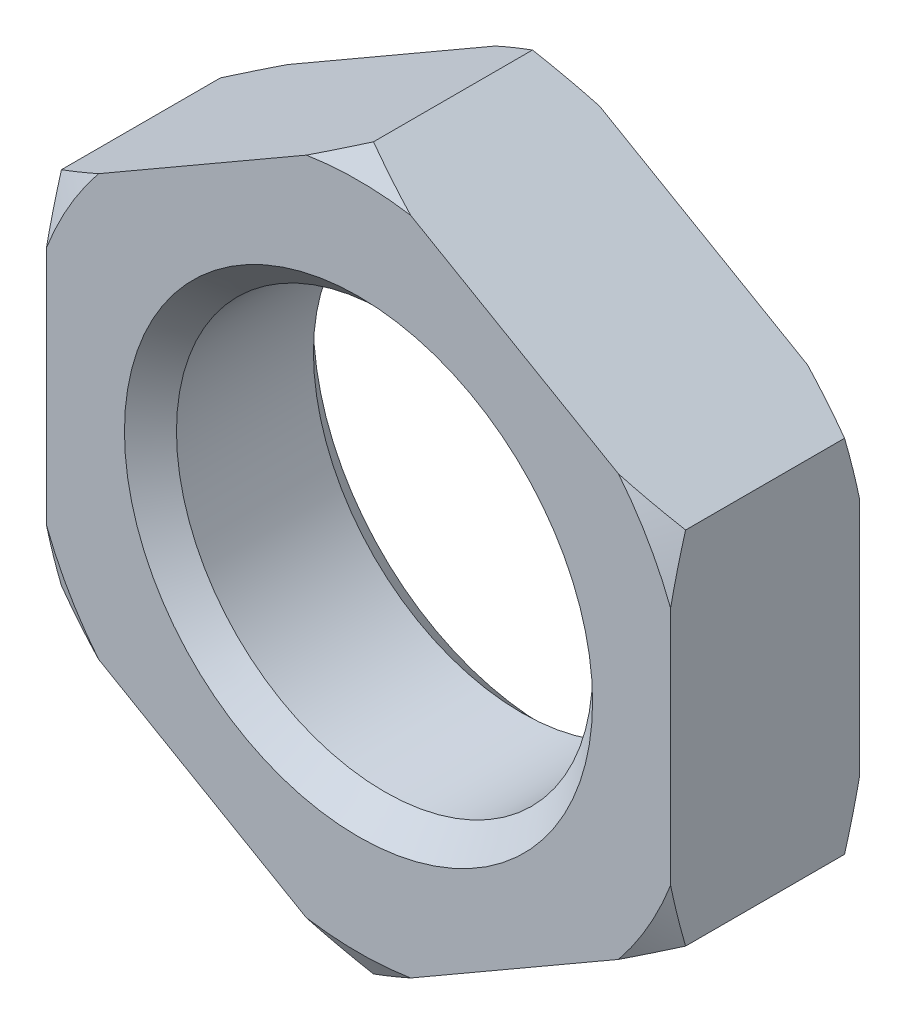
ISO-10303-21;
HEADER;
FILE_DESCRIPTION(('STEP AP214'),'2;1');
FILE_NAME('part.step','',(''),(''),'','','');
FILE_SCHEMA(('AUTOMOTIVE_DESIGN { 1 0 10303 214 1 1 1 1 }'));
ENDSEC;
DATA;
#1=APPLICATION_CONTEXT('core data for automotive mechanical design processes');
#2=APPLICATION_PROTOCOL_DEFINITION('international standard','automotive_design',2000,#1);
#3=PRODUCT_CONTEXT('',#1,'mechanical');
#4=PRODUCT('Part','Part','',(#3));
#5=PRODUCT_RELATED_PRODUCT_CATEGORY('part','',(#4));
#6=PRODUCT_DEFINITION_FORMATION('','',#4);
#7=PRODUCT_DEFINITION_CONTEXT('part definition',#1,'design');
#8=PRODUCT_DEFINITION('design','',#6,#7);
#9=PRODUCT_DEFINITION_SHAPE('','',#8);
#10=(LENGTH_UNIT() NAMED_UNIT(*) SI_UNIT(.MILLI.,.METRE.));
#11=(NAMED_UNIT(*) PLANE_ANGLE_UNIT() SI_UNIT($,.RADIAN.));
#12=(NAMED_UNIT(*) SI_UNIT($,.STERADIAN.) SOLID_ANGLE_UNIT());
#13=UNCERTAINTY_MEASURE_WITH_UNIT(LENGTH_MEASURE(1.E-05),#10,'distance_accuracy_value','');
#14=(GEOMETRIC_REPRESENTATION_CONTEXT(3) GLOBAL_UNCERTAINTY_ASSIGNED_CONTEXT((#13)) GLOBAL_UNIT_ASSIGNED_CONTEXT((#10,
#11,#12)) REPRESENTATION_CONTEXT('',''));
#15=CARTESIAN_POINT('',(0.,0.,0.));
#16=DIRECTION('',(0.,0.,1.));
#17=DIRECTION('',(1.,0.,0.));
#18=AXIS2_PLACEMENT_3D('',#15,#16,#17);
#19=CARTESIAN_POINT('',(0.,0.,-5.45));
#20=DIRECTION('',(0.,0.,1.));
#21=DIRECTION('',(1.,0.,0.));
#22=AXIS2_PLACEMENT_3D('',#19,#20,#21);
#23=PLANE('',#22);
#24=CARTESIAN_POINT('',(0.,0.,-5.45));
#25=DIRECTION('',(0.,0.,1.));
#26=DIRECTION('',(1.,0.,0.));
#27=AXIS2_PLACEMENT_3D('',#24,#25,#26);
#28=CIRCLE('',#27,13.5);
#29=CARTESIAN_POINT('',(13.5,0.,-5.45));
#30=VERTEX_POINT('',#29);
#31=EDGE_CURVE('E425',#30,#30,#28,.T.);
#32=ORIENTED_EDGE('',*,*,#31,.T.);
#33=EDGE_LOOP('',(#32));
#34=FACE_BOUND('',#33,.T.);
#35=DIRECTION('',(0.,1.,0.));
#36=VECTOR('',#35,1.);
#37=CARTESIAN_POINT('',(18.,-10.3923048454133,-5.45));
#38=LINE('',#37,#36);
#39=CARTESIAN_POINT('',(18.,-6.92070595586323,-5.45));
#40=VERTEX_POINT('',#39);
#41=CARTESIAN_POINT('',(18.,6.92070595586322,-5.45));
#42=VERTEX_POINT('',#41);
#43=EDGE_CURVE('E363',#40,#42,#38,.T.);
#44=ORIENTED_EDGE('',*,*,#43,.F.);
#45=CARTESIAN_POINT('',(0.,0.,-5.45));
#46=DIRECTION('',(0.,0.,-1.));
#47=DIRECTION('',(-1.,0.,0.));
#48=AXIS2_PLACEMENT_3D('',#45,#46,#47);
#49=CIRCLE('',#48,19.2846096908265);
#50=CARTESIAN_POINT('',(14.9935071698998,-12.1281042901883,-5.45));
#51=VERTEX_POINT('',#50);
#52=EDGE_CURVE('E350',#40,#51,#49,.T.);
#53=ORIENTED_EDGE('',*,*,#52,.T.);
#54=DIRECTION('',(0.866025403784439,0.5,0.));
#55=VECTOR('',#54,1.);
#56=CARTESIAN_POINT('',(0.,-20.7846096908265,-5.45));
#57=LINE('',#56,#55);
#58=CARTESIAN_POINT('',(3.0064928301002,-19.0488102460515,-5.45));
#59=VERTEX_POINT('',#58);
#60=EDGE_CURVE('E373',#59,#51,#57,.T.);
#61=ORIENTED_EDGE('',*,*,#60,.F.);
#62=CARTESIAN_POINT('',(-3.0064928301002,-19.0488102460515,-5.45));
#63=VERTEX_POINT('',#62);
#64=EDGE_CURVE('E344',#59,#63,#49,.T.);
#65=ORIENTED_EDGE('',*,*,#64,.T.);
#66=DIRECTION('',(0.866025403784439,-0.5,0.));
#67=VECTOR('',#66,1.);
#68=CARTESIAN_POINT('',(-18.,-10.3923048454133,-5.45));
#69=LINE('',#68,#67);
#70=CARTESIAN_POINT('',(-14.9935071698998,-12.1281042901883,-5.45));
#71=VERTEX_POINT('',#70);
#72=EDGE_CURVE('E379',#71,#63,#69,.T.);
#73=ORIENTED_EDGE('',*,*,#72,.F.);
#74=CARTESIAN_POINT('',(-18.,-6.9207059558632,-5.45));
#75=VERTEX_POINT('',#74);
#76=EDGE_CURVE('E336',#71,#75,#49,.T.);
#77=ORIENTED_EDGE('',*,*,#76,.T.);
#78=DIRECTION('',(0.,-1.,0.));
#79=VECTOR('',#78,1.);
#80=CARTESIAN_POINT('',(-18.,10.3923048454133,-5.45));
#81=LINE('',#80,#79);
#82=CARTESIAN_POINT('',(-18.,6.9207059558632,-5.45));
#83=VERTEX_POINT('',#82);
#84=EDGE_CURVE('E474',#83,#75,#81,.T.);
#85=ORIENTED_EDGE('',*,*,#84,.F.);
#86=CARTESIAN_POINT('',(-14.9935071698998,12.1281042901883,-5.45));
#87=VERTEX_POINT('',#86);
#88=EDGE_CURVE('E63',#83,#87,#49,.T.);
#89=ORIENTED_EDGE('',*,*,#88,.T.);
#90=DIRECTION('',(-0.866025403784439,-0.5,0.));
#91=VECTOR('',#90,1.);
#92=CARTESIAN_POINT('',(0.,20.7846096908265,-5.45));
#93=LINE('',#92,#91);
#94=CARTESIAN_POINT('',(-3.0064928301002,19.0488102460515,-5.45));
#95=VERTEX_POINT('',#94);
#96=EDGE_CURVE('E181',#95,#87,#93,.T.);
#97=ORIENTED_EDGE('',*,*,#96,.F.);
#98=CARTESIAN_POINT('',(3.00649283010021,19.0488102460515,-5.45));
#99=VERTEX_POINT('',#98);
#100=EDGE_CURVE('E55',#95,#99,#49,.T.);
#101=ORIENTED_EDGE('',*,*,#100,.T.);
#102=DIRECTION('',(-0.866025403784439,0.5,0.));
#103=VECTOR('',#102,1.);
#104=CARTESIAN_POINT('',(18.,10.3923048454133,-5.45));
#105=LINE('',#104,#103);
#106=CARTESIAN_POINT('',(14.9935071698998,12.1281042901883,-5.45));
#107=VERTEX_POINT('',#106);
#108=EDGE_CURVE('E364',#107,#99,#105,.T.);
#109=ORIENTED_EDGE('',*,*,#108,.F.);
#110=EDGE_CURVE('E341',#107,#42,#49,.T.);
#111=ORIENTED_EDGE('',*,*,#110,.T.);
#112=EDGE_LOOP('',(#44,#53,#61,#65,#73,#77,#85,#89,#97,#101,#109,#111));
#113=FACE_BOUND('',#112,.T.);
#114=ADVANCED_FACE('F39',(#34,#113),#23,.F.);
#115=CARTESIAN_POINT('',(0.,0.,5.45));
#116=DIRECTION('',(0.,0.,1.));
#117=DIRECTION('',(1.,0.,0.));
#118=AXIS2_PLACEMENT_3D('',#115,#116,#117);
#119=PLANE('',#118);
#120=CARTESIAN_POINT('',(0.,0.,5.45));
#121=DIRECTION('',(0.,0.,1.));
#122=DIRECTION('',(1.,0.,0.));
#123=AXIS2_PLACEMENT_3D('',#120,#121,#122);
#124=CIRCLE('',#123,13.5);
#125=CARTESIAN_POINT('',(13.5,0.,5.45));
#126=VERTEX_POINT('',#125);
#127=EDGE_CURVE('E11',#126,#126,#124,.F.);
#128=ORIENTED_EDGE('',*,*,#127,.T.);
#129=EDGE_LOOP('',(#128));
#130=FACE_BOUND('',#129,.T.);
#131=CARTESIAN_POINT('',(0.,0.,5.45));
#132=DIRECTION('',(0.,0.,-1.));
#133=DIRECTION('',(-1.,0.,0.));
#134=AXIS2_PLACEMENT_3D('',#131,#132,#133);
#135=CIRCLE('',#134,19.2846096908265);
#136=CARTESIAN_POINT('',(18.,-6.92070595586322,5.45));
#137=VERTEX_POINT('',#136);
#138=CARTESIAN_POINT('',(14.9935071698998,-12.1281042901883,5.45));
#139=VERTEX_POINT('',#138);
#140=EDGE_CURVE('E314',#137,#139,#135,.T.);
#141=ORIENTED_EDGE('',*,*,#140,.F.);
#142=DIRECTION('',(0.,1.,0.));
#143=VECTOR('',#142,1.);
#144=CARTESIAN_POINT('',(18.,-10.3923048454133,5.45));
#145=LINE('',#144,#143);
#146=CARTESIAN_POINT('',(18.,6.92070595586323,5.45));
#147=VERTEX_POINT('',#146);
#148=EDGE_CURVE('E386',#137,#147,#145,.T.);
#149=ORIENTED_EDGE('',*,*,#148,.T.);
#150=CARTESIAN_POINT('',(14.9935071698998,12.1281042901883,5.45));
#151=VERTEX_POINT('',#150);
#152=EDGE_CURVE('E306',#151,#147,#135,.T.);
#153=ORIENTED_EDGE('',*,*,#152,.F.);
#154=DIRECTION('',(-0.866025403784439,0.5,0.));
#155=VECTOR('',#154,1.);
#156=CARTESIAN_POINT('',(18.,10.3923048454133,5.45));
#157=LINE('',#156,#155);
#158=CARTESIAN_POINT('',(3.00649283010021,19.0488102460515,5.45));
#159=VERTEX_POINT('',#158);
#160=EDGE_CURVE('E372',#151,#159,#157,.T.);
#161=ORIENTED_EDGE('',*,*,#160,.T.);
#162=CARTESIAN_POINT('',(-3.0064928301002,19.0488102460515,5.45));
#163=VERTEX_POINT('',#162);
#164=EDGE_CURVE('E296',#163,#159,#135,.T.);
#165=ORIENTED_EDGE('',*,*,#164,.F.);
#166=DIRECTION('',(-0.866025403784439,-0.5,0.));
#167=VECTOR('',#166,1.);
#168=CARTESIAN_POINT('',(0.,20.7846096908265,5.45));
#169=LINE('',#168,#167);
#170=CARTESIAN_POINT('',(-14.9935071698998,12.1281042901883,5.45));
#171=VERTEX_POINT('',#170);
#172=EDGE_CURVE('E377',#163,#171,#169,.T.);
#173=ORIENTED_EDGE('',*,*,#172,.T.);
#174=CARTESIAN_POINT('',(-18.,6.9207059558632,5.45));
#175=VERTEX_POINT('',#174);
#176=EDGE_CURVE('E294',#175,#171,#135,.T.);
#177=ORIENTED_EDGE('',*,*,#176,.F.);
#178=DIRECTION('',(0.,-1.,0.));
#179=VECTOR('',#178,1.);
#180=CARTESIAN_POINT('',(-18.,10.3923048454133,5.45));
#181=LINE('',#180,#179);
#182=CARTESIAN_POINT('',(-18.,-6.9207059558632,5.45));
#183=VERTEX_POINT('',#182);
#184=EDGE_CURVE('E477',#175,#183,#181,.T.);
#185=ORIENTED_EDGE('',*,*,#184,.T.);
#186=CARTESIAN_POINT('',(-14.9935071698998,-12.1281042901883,5.45));
#187=VERTEX_POINT('',#186);
#188=EDGE_CURVE('E297',#187,#183,#135,.T.);
#189=ORIENTED_EDGE('',*,*,#188,.F.);
#190=DIRECTION('',(0.866025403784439,-0.5,0.));
#191=VECTOR('',#190,1.);
#192=CARTESIAN_POINT('',(-18.,-10.3923048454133,5.45));
#193=LINE('',#192,#191);
#194=CARTESIAN_POINT('',(-3.0064928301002,-19.0488102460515,5.45));
#195=VERTEX_POINT('',#194);
#196=EDGE_CURVE('E466',#187,#195,#193,.T.);
#197=ORIENTED_EDGE('',*,*,#196,.T.);
#198=CARTESIAN_POINT('',(3.0064928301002,-19.0488102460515,5.45));
#199=VERTEX_POINT('',#198);
#200=EDGE_CURVE('E308',#199,#195,#135,.T.);
#201=ORIENTED_EDGE('',*,*,#200,.F.);
#202=DIRECTION('',(0.866025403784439,0.5,0.));
#203=VECTOR('',#202,1.);
#204=CARTESIAN_POINT('',(0.,-20.7846096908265,5.45));
#205=LINE('',#204,#203);
#206=EDGE_CURVE('E464',#199,#139,#205,.T.);
#207=ORIENTED_EDGE('',*,*,#206,.T.);
#208=EDGE_LOOP('',(#141,#149,#153,#161,#165,#173,#177,#185,#189,#197,#201,#207));
#209=FACE_BOUND('',#208,.T.);
#210=ADVANCED_FACE('F416',(#130,#209),#119,.T.);
#211=CARTESIAN_POINT('',(18.,10.3923048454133,5.45));
#212=DIRECTION('',(-0.5,-0.866025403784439,0.));
#213=DIRECTION('',(0.866025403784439,-0.5,0.));
#214=AXIS2_PLACEMENT_3D('',#211,#212,#213);
#215=PLANE('',#214);
#216=DIRECTION('',(0.,0.,-1.));
#217=VECTOR('',#216,1.);
#218=CARTESIAN_POINT('',(18.,10.3923048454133,5.45));
#219=LINE('',#218,#217);
#220=CARTESIAN_POINT('',(18.,10.3923048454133,4.58397459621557));
#221=VERTEX_POINT('',#220);
#222=CARTESIAN_POINT('',(18.,10.3923048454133,-4.58397459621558));
#223=VERTEX_POINT('',#222);
#224=EDGE_CURVE('E383',#221,#223,#219,.T.);
#225=ORIENTED_EDGE('',*,*,#224,.T.);
#226=CARTESIAN_POINT('',(30.4817864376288,3.18594208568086,1.11055875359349));
#227=CARTESIAN_POINT('',(30.1990710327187,3.34916790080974,0.958016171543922));
#228=CARTESIAN_POINT('',(29.9160125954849,3.51259176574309,0.806321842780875));
#229=CARTESIAN_POINT('',(29.3491495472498,3.83987029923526,0.504795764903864));
#230=CARTESIAN_POINT('',(29.0653449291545,4.00372497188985,0.354964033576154));
#231=CARTESIAN_POINT('',(28.2126632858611,4.49602094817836,-0.0915186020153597));
#232=CARTESIAN_POINT('',(27.6425845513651,4.82515605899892,-0.385121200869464));
#233=CARTESIAN_POINT('',(26.4968753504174,5.48663157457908,-0.963472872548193));
#234=CARTESIAN_POINT('',(25.9212329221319,5.81897888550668,-1.24819041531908));
#235=CARTESIAN_POINT('',(24.7656308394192,6.48616605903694,-1.80567154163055));
#236=CARTESIAN_POINT('',(24.1856713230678,6.82100584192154,-2.07843550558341));
#237=CARTESIAN_POINT('',(23.0059909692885,7.50209461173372,-2.61611067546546));
#238=CARTESIAN_POINT('',(22.406141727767,7.84841773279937,-2.88064786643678));
#239=CARTESIAN_POINT('',(21.200382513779,8.54456313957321,-3.390840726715));
#240=CARTESIAN_POINT('',(20.5944722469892,8.89438559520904,-3.63649547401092));
#241=CARTESIAN_POINT('',(19.3764811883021,9.59759306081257,-4.10423475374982));
#242=CARTESIAN_POINT('',(18.7644070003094,9.9509742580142,-4.32634207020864));
#243=CARTESIAN_POINT('',(17.5329892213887,10.661933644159,-4.7418633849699));
#244=CARTESIAN_POINT('',(16.9136465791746,11.0195112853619,-4.93528108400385));
#245=CARTESIAN_POINT('',(15.8615309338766,11.6269505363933,-5.232427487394));
#246=CARTESIAN_POINT('',(15.4307015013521,11.8756900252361,-5.34533215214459));
#247=CARTESIAN_POINT('',(14.5656644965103,12.3751193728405,-5.55242972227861));
#248=CARTESIAN_POINT('',(14.131456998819,12.6258091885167,-5.64662303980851));
#249=CARTESIAN_POINT('',(13.2601312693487,13.1288693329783,-5.81416471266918));
#250=CARTESIAN_POINT('',(12.8230138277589,13.3812392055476,-5.88751850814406));
#251=CARTESIAN_POINT('',(11.9463523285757,13.8873799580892,-6.01152465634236));
#252=CARTESIAN_POINT('',(11.5068082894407,14.1411508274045,-6.06217718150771));
#253=CARTESIAN_POINT('',(10.631220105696,14.6466719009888,-6.13888539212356));
#254=CARTESIAN_POINT('',(10.1951943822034,14.8984114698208,-6.16521914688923));
#255=CARTESIAN_POINT('',(9.32255170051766,15.4022319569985,-6.19350609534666));
#256=CARTESIAN_POINT('',(8.88593475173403,15.6543128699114,-6.19545967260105));
#257=CARTESIAN_POINT('',(8.01311044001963,16.158238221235,-6.17492447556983));
#258=CARTESIAN_POINT('',(7.57690310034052,16.4100826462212,-6.15243438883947));
#259=CARTESIAN_POINT('',(6.70589784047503,16.9129577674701,-6.08369353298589));
#260=CARTESIAN_POINT('',(6.27109998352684,17.1639884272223,-6.03744171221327));
#261=CARTESIAN_POINT('',(5.24329436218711,17.7573922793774,-5.90119330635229));
#262=CARTESIAN_POINT('',(4.65125869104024,18.0992042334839,-5.80134385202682));
#263=CARTESIAN_POINT('',(3.47285610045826,18.7795552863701,-5.56412731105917));
#264=CARTESIAN_POINT('',(2.88649014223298,19.1180938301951,-5.42675397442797));
#265=CARTESIAN_POINT('',(1.71957657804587,19.7918116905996,-5.11969661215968));
#266=CARTESIAN_POINT('',(1.13903549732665,20.1269872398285,-4.94997986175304));
#267=CARTESIAN_POINT('',(-0.0155436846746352,20.7935838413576,-4.58356382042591));
#268=CARTESIAN_POINT('',(-0.589581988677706,21.125005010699,-4.38686537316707));
#269=CARTESIAN_POINT('',(-1.73814136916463,21.7881260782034,-3.96875439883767));
#270=CARTESIAN_POINT('',(-2.31259097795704,22.1197847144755,-3.74708193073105));
#271=CARTESIAN_POINT('',(-3.45578835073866,22.7798100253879,-3.28501826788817));
#272=CARTESIAN_POINT('',(-4.02453606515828,23.108176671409,-3.04462691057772));
#273=CARTESIAN_POINT('',(-5.15667022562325,23.7618146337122,-2.54863199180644));
#274=CARTESIAN_POINT('',(-5.72005933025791,24.0870874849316,-2.29303648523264));
#275=CARTESIAN_POINT('',(-6.84240142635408,24.7350719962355,-1.76925073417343));
#276=CARTESIAN_POINT('',(-7.40135451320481,25.0577837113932,-1.50106076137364));
#277=CARTESIAN_POINT('',(-8.34048983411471,25.599993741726,-1.04011774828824));
#278=CARTESIAN_POINT('',(-8.721691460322,25.8200806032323,-0.850122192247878));
#279=CARTESIAN_POINT('',(-9.4824435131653,26.2593010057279,-0.465812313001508));
#280=CARTESIAN_POINT('',(-9.861993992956,26.4784345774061,-0.271498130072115));
#281=CARTESIAN_POINT('',(-10.6156609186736,26.9135643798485,0.118898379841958));
#282=CARTESIAN_POINT('',(-10.9897927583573,27.1295694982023,0.314941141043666));
#283=CARTESIAN_POINT('',(-11.7367430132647,27.5608214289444,0.710356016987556));
#284=CARTESIAN_POINT('',(-12.1095614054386,27.7760682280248,0.909728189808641));
#285=CARTESIAN_POINT('',(-12.4817864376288,27.990972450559,1.1105587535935));
#286=B_SPLINE_CURVE_WITH_KNOTS('',3,(#226,#227,#228,#229,#230,#231,#232,#233,#234,#235,#236,
#237,#238,#239,#240,#241,#242,#243,#244,#245,#246,#247,#248,#249,#250,#251,#252,#253,#254,#255,
#256,#257,#258,#259,#260,#261,#262,#263,#264,#265,#266,#267,#268,#269,#270,#271,#272,#273,#274,
#275,#276,#277,#278,#279,#280,#281,#282,#283,#284,#285),.UNSPECIFIED.,.F.,.F.,(4,2,2,2,2,2,2,2,
2,2,2,2,2,2,2,2,2,2,2,2,2,2,2,2,2,2,2,2,2,4),(0.,1.08099687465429,2.16200406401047,
4.32427120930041,6.49349632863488,8.66265236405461,10.8867628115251,13.1109817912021,
15.3330286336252,17.5547886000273,19.0848741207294,20.6149259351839,22.144577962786,
23.6742183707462,25.1861435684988,26.6980449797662,28.2100275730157,29.7220770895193,
31.7934548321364,33.8651777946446,35.9390081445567,38.0127736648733,40.1105666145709,
42.2083777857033,44.3050873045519,46.4017516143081,47.8400132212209,49.2782281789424,
50.7014461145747,52.1246889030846),.UNSPECIFIED.);
#287=EDGE_CURVE('E318',#223,#107,#286,.T.);
#288=ORIENTED_EDGE('',*,*,#287,.T.);
#289=ORIENTED_EDGE('',*,*,#108,.T.);
#290=CARTESIAN_POINT('',(0.,20.7846096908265,-4.58397459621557));
#291=VERTEX_POINT('',#290);
#292=EDGE_CURVE('E309',#99,#291,#286,.T.);
#293=ORIENTED_EDGE('',*,*,#292,.T.);
#294=DIRECTION('',(0.,0.,-1.));
#295=VECTOR('',#294,1.);
#296=CARTESIAN_POINT('',(0.,20.7846096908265,5.45));
#297=LINE('',#296,#295);
#298=CARTESIAN_POINT('',(0.,20.7846096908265,4.58397459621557));
#299=VERTEX_POINT('',#298);
#300=EDGE_CURVE('E190',#299,#291,#297,.T.);
#301=ORIENTED_EDGE('',*,*,#300,.F.);
#302=CARTESIAN_POINT('',(-12.4817864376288,27.9909724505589,-1.1105587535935));
#303=CARTESIAN_POINT('',(-12.1990710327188,27.8277466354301,-0.958016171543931));
#304=CARTESIAN_POINT('',(-11.9160125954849,27.6643227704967,-0.806321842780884));
#305=CARTESIAN_POINT('',(-11.3491495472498,27.3370442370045,-0.504795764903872));
#306=CARTESIAN_POINT('',(-11.0653449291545,27.17318956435,-0.354964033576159));
#307=CARTESIAN_POINT('',(-10.2126632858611,26.6808935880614,0.0915186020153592));
#308=CARTESIAN_POINT('',(-9.64258455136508,26.3517584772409,0.385121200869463));
#309=CARTESIAN_POINT('',(-8.49687535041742,25.6902829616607,0.96347287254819));
#310=CARTESIAN_POINT('',(-7.92123292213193,25.3579356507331,1.24819041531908));
#311=CARTESIAN_POINT('',(-6.76563083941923,24.6907484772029,1.80567154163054));
#312=CARTESIAN_POINT('',(-6.18567132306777,24.3559086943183,2.07843550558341));
#313=CARTESIAN_POINT('',(-5.00599096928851,23.6748199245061,2.61611067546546));
#314=CARTESIAN_POINT('',(-4.40614172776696,23.3284968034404,2.88064786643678));
#315=CARTESIAN_POINT('',(-3.20038251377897,22.6323513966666,3.390840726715));
#316=CARTESIAN_POINT('',(-2.5944722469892,22.2825289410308,3.63649547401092));
#317=CARTESIAN_POINT('',(-1.37648118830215,21.5793214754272,4.10423475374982));
#318=CARTESIAN_POINT('',(-0.764407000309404,21.2259402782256,4.32634207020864));
#319=CARTESIAN_POINT('',(0.467010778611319,20.5149808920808,4.7418633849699));
#320=CARTESIAN_POINT('',(1.08635342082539,20.1574032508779,4.93528108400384));
#321=CARTESIAN_POINT('',(2.13846906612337,19.5499639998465,5.232427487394));
#322=CARTESIAN_POINT('',(2.56929849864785,19.3012245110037,5.34533215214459));
#323=CARTESIAN_POINT('',(3.4343355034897,18.8017951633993,5.55242972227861));
#324=CARTESIAN_POINT('',(3.86854300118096,18.5511053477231,5.64662303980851));
#325=CARTESIAN_POINT('',(4.73986873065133,18.0480452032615,5.81416471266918));
#326=CARTESIAN_POINT('',(5.1769861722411,17.7956753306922,5.88751850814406));
#327=CARTESIAN_POINT('',(6.0536476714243,17.2895345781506,6.01152465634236));
#328=CARTESIAN_POINT('',(6.49319171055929,17.0357637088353,6.06217718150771));
#329=CARTESIAN_POINT('',(7.36877989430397,16.530242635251,6.13888539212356));
#330=CARTESIAN_POINT('',(7.80480561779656,16.278503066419,6.16521914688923));
#331=CARTESIAN_POINT('',(8.67744829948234,15.7746825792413,6.19350609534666));
#332=CARTESIAN_POINT('',(9.11406524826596,15.5226016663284,6.19545967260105));
#333=CARTESIAN_POINT('',(9.98688955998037,15.0186763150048,6.17492447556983));
#334=CARTESIAN_POINT('',(10.4230968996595,14.7668318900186,6.15243438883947));
#335=CARTESIAN_POINT('',(11.294102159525,14.2639567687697,6.08369353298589));
#336=CARTESIAN_POINT('',(11.7289000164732,14.0129261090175,6.03744171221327));
#337=CARTESIAN_POINT('',(12.7567056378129,13.4195222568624,5.90119330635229));
#338=CARTESIAN_POINT('',(13.3487413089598,13.0777103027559,5.80134385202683));
#339=CARTESIAN_POINT('',(14.5271438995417,12.3973592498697,5.56412731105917));
#340=CARTESIAN_POINT('',(15.113509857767,12.0588207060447,5.42675397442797));
#341=CARTESIAN_POINT('',(16.2804234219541,11.3851028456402,5.11969661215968));
#342=CARTESIAN_POINT('',(16.8609645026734,11.0499272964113,4.94997986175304));
#343=CARTESIAN_POINT('',(18.0155436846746,10.3833306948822,4.58356382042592));
#344=CARTESIAN_POINT('',(18.5895819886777,10.0519095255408,4.38686537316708));
#345=CARTESIAN_POINT('',(19.7381413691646,9.38878845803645,3.96875439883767));
#346=CARTESIAN_POINT('',(20.312590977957,9.05712982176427,3.74708193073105));
#347=CARTESIAN_POINT('',(21.4557883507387,8.39710451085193,3.28501826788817));
#348=CARTESIAN_POINT('',(22.0245360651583,8.06873786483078,3.04462691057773));
#349=CARTESIAN_POINT('',(23.1566702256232,7.41509990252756,2.54863199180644));
#350=CARTESIAN_POINT('',(23.7200593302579,7.08982705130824,2.29303648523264));
#351=CARTESIAN_POINT('',(24.8424014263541,6.44184254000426,1.76925073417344));
#352=CARTESIAN_POINT('',(25.4013545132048,6.11913082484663,1.50106076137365));
#353=CARTESIAN_POINT('',(26.3404898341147,5.57692079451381,1.04011774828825));
#354=CARTESIAN_POINT('',(26.721691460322,5.35683393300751,0.850122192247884));
#355=CARTESIAN_POINT('',(27.4824435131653,4.91761353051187,0.465812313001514));
#356=CARTESIAN_POINT('',(27.861993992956,4.69847995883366,0.271498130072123));
#357=CARTESIAN_POINT('',(28.6156609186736,4.2633501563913,-0.11889837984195));
#358=CARTESIAN_POINT('',(28.9897927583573,4.04734503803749,-0.314941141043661));
#359=CARTESIAN_POINT('',(29.7367430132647,3.61609310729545,-0.710356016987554));
#360=CARTESIAN_POINT('',(30.1095614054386,3.40084630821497,-0.909728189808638));
#361=CARTESIAN_POINT('',(30.4817864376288,3.18594208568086,-1.11055875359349));
#362=B_SPLINE_CURVE_WITH_KNOTS('',3,(#302,#303,#304,#305,#306,#307,#308,#309,#310,#311,#312,
#313,#314,#315,#316,#317,#318,#319,#320,#321,#322,#323,#324,#325,#326,#327,#328,#329,#330,#331,
#332,#333,#334,#335,#336,#337,#338,#339,#340,#341,#342,#343,#344,#345,#346,#347,#348,#349,#350,
#351,#352,#353,#354,#355,#356,#357,#358,#359,#360,#361),.UNSPECIFIED.,.F.,.F.,(4,2,2,2,2,2,2,2,
2,2,2,2,2,2,2,2,2,2,2,2,2,2,2,2,2,2,2,2,2,4),(0.,1.08099687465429,2.16200406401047,
4.32427120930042,6.49349632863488,8.66265236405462,10.8867628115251,13.1109817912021,
15.3330286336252,17.5547886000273,19.0848741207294,20.6149259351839,22.144577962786,
23.6742183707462,25.1861435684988,26.6980449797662,28.2100275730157,29.7220770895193,
31.7934548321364,33.8651777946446,35.9390081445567,38.0127736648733,40.1105666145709,
42.2083777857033,44.3050873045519,46.4017516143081,47.8400132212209,49.2782281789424,
50.7014461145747,52.1246889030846),.UNSPECIFIED.);
#363=EDGE_CURVE('E472',#299,#159,#362,.T.);
#364=ORIENTED_EDGE('',*,*,#363,.T.);
#365=ORIENTED_EDGE('',*,*,#160,.F.);
#366=EDGE_CURVE('E247',#151,#221,#362,.T.);
#367=ORIENTED_EDGE('',*,*,#366,.T.);
#368=EDGE_LOOP('',(#225,#288,#289,#293,#301,#364,#365,#367));
#369=FACE_BOUND('',#368,.T.);
#370=ADVANCED_FACE('F421',(#369),#215,.F.);
#371=CARTESIAN_POINT('',(0.,20.7846096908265,5.45));
#372=DIRECTION('',(0.5,-0.866025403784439,0.));
#373=DIRECTION('',(0.866025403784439,0.5,0.));
#374=AXIS2_PLACEMENT_3D('',#371,#372,#373);
#375=PLANE('',#374);
#376=ORIENTED_EDGE('',*,*,#300,.T.);
#377=CARTESIAN_POINT('',(12.4817864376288,27.9909724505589,1.1105587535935));
#378=CARTESIAN_POINT('',(12.1990710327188,27.8277466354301,0.958016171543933));
#379=CARTESIAN_POINT('',(11.9160125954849,27.6643227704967,0.806321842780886));
#380=CARTESIAN_POINT('',(11.3491495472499,27.3370442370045,0.504795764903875));
#381=CARTESIAN_POINT('',(11.0653449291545,27.17318956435,0.354964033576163));
#382=CARTESIAN_POINT('',(10.2126632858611,26.6808935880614,-0.0915186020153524));
#383=CARTESIAN_POINT('',(9.64258455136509,26.3517584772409,-0.385121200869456));
#384=CARTESIAN_POINT('',(8.49687535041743,25.6902829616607,-0.963472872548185));
#385=CARTESIAN_POINT('',(7.92123292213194,25.3579356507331,-1.24819041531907));
#386=CARTESIAN_POINT('',(6.76563083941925,24.6907484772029,-1.80567154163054));
#387=CARTESIAN_POINT('',(6.18567132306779,24.3559086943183,-2.07843550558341));
#388=CARTESIAN_POINT('',(5.00599096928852,23.6748199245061,-2.61611067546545));
#389=CARTESIAN_POINT('',(4.40614172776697,23.3284968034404,-2.88064786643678));
#390=CARTESIAN_POINT('',(3.20038251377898,22.6323513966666,-3.390840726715));
#391=CARTESIAN_POINT('',(2.59447224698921,22.2825289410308,-3.63649547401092));
#392=CARTESIAN_POINT('',(1.37648118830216,21.5793214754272,-4.10423475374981));
#393=CARTESIAN_POINT('',(0.764407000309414,21.2259402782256,-4.32634207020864));
#394=CARTESIAN_POINT('',(-0.467010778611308,20.5149808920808,-4.7418633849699));
#395=CARTESIAN_POINT('',(-1.08635342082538,20.1574032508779,-4.93528108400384));
#396=CARTESIAN_POINT('',(-2.13846906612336,19.5499639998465,-5.232427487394));
#397=CARTESIAN_POINT('',(-2.56929849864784,19.3012245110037,-5.34533215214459));
#398=CARTESIAN_POINT('',(-3.43433550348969,18.8017951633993,-5.55242972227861));
#399=CARTESIAN_POINT('',(-3.86854300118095,18.5511053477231,-5.64662303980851));
#400=CARTESIAN_POINT('',(-4.73986873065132,18.0480452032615,-5.81416471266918));
#401=CARTESIAN_POINT('',(-5.17698617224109,17.7956753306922,-5.88751850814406));
#402=CARTESIAN_POINT('',(-6.05364767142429,17.2895345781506,-6.01152465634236));
#403=CARTESIAN_POINT('',(-6.49319171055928,17.0357637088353,-6.06217718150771));
#404=CARTESIAN_POINT('',(-7.36877989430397,16.530242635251,-6.13888539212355));
#405=CARTESIAN_POINT('',(-7.80480561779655,16.278503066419,-6.16521914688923));
#406=CARTESIAN_POINT('',(-8.67744829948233,15.7746825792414,-6.19350609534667));
#407=CARTESIAN_POINT('',(-9.11406524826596,15.5226016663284,-6.19545967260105));
#408=CARTESIAN_POINT('',(-9.98688955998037,15.0186763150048,-6.17492447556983));
#409=CARTESIAN_POINT('',(-10.4230968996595,14.7668318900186,-6.15243438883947));
#410=CARTESIAN_POINT('',(-11.294102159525,14.2639567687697,-6.08369353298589));
#411=CARTESIAN_POINT('',(-11.7289000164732,14.0129261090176,-6.03744171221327));
#412=CARTESIAN_POINT('',(-12.7567056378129,13.4195222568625,-5.90119330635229));
#413=CARTESIAN_POINT('',(-13.3487413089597,13.0777103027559,-5.80134385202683));
#414=CARTESIAN_POINT('',(-14.5271438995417,12.3973592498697,-5.56412731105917));
#415=CARTESIAN_POINT('',(-15.113509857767,12.0588207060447,-5.42675397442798));
#416=CARTESIAN_POINT('',(-16.2804234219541,11.3851028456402,-5.11969661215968));
#417=CARTESIAN_POINT('',(-16.8609645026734,11.0499272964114,-4.94997986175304));
#418=CARTESIAN_POINT('',(-18.0155436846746,10.3833306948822,-4.58356382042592));
#419=CARTESIAN_POINT('',(-18.5895819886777,10.0519095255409,-4.38686537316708));
#420=CARTESIAN_POINT('',(-19.7381413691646,9.38878845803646,-3.96875439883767));
#421=CARTESIAN_POINT('',(-20.312590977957,9.05712982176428,-3.74708193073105));
#422=CARTESIAN_POINT('',(-21.4557883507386,8.39710451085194,-3.28501826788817));
#423=CARTESIAN_POINT('',(-22.0245360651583,8.06873786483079,-3.04462691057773));
#424=CARTESIAN_POINT('',(-23.1566702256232,7.41509990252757,-2.54863199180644));
#425=CARTESIAN_POINT('',(-23.7200593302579,7.08982705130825,-2.29303648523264));
#426=CARTESIAN_POINT('',(-24.8424014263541,6.44184254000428,-1.76925073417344));
#427=CARTESIAN_POINT('',(-25.4013545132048,6.11913082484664,-1.50106076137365));
#428=CARTESIAN_POINT('',(-26.3404898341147,5.57692079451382,-1.04011774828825));
#429=CARTESIAN_POINT('',(-26.721691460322,5.35683393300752,-0.850122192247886));
#430=CARTESIAN_POINT('',(-27.4824435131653,4.91761353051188,-0.465812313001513));
#431=CARTESIAN_POINT('',(-27.861993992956,4.69847995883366,-0.271498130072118));
#432=CARTESIAN_POINT('',(-28.6156609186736,4.26335015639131,0.11889837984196));
#433=CARTESIAN_POINT('',(-28.9897927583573,4.04734503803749,0.314941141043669));
#434=CARTESIAN_POINT('',(-29.7367430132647,3.61609310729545,0.710356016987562));
#435=CARTESIAN_POINT('',(-30.1095614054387,3.40084630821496,0.909728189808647));
#436=CARTESIAN_POINT('',(-30.4817864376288,3.18594208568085,1.1105587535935));
#437=B_SPLINE_CURVE_WITH_KNOTS('',3,(#377,#378,#379,#380,#381,#382,#383,#384,#385,#386,#387,
#388,#389,#390,#391,#392,#393,#394,#395,#396,#397,#398,#399,#400,#401,#402,#403,#404,#405,#406,
#407,#408,#409,#410,#411,#412,#413,#414,#415,#416,#417,#418,#419,#420,#421,#422,#423,#424,#425,
#426,#427,#428,#429,#430,#431,#432,#433,#434,#435,#436),.UNSPECIFIED.,.F.,.F.,(4,2,2,2,2,2,2,2,
2,2,2,2,2,2,2,2,2,2,2,2,2,2,2,2,2,2,2,2,2,4),(0.,1.08099687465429,2.16200406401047,
4.32427120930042,6.49349632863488,8.66265236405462,10.8867628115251,13.1109817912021,
15.3330286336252,17.5547886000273,19.0848741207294,20.6149259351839,22.144577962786,
23.6742183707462,25.1861435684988,26.6980449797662,28.2100275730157,29.7220770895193,
31.7934548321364,33.8651777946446,35.9390081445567,38.0127736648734,40.1105666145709,
42.2083777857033,44.3050873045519,46.4017516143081,47.8400132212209,49.2782281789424,
50.7014461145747,52.1246889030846),.UNSPECIFIED.);
#438=EDGE_CURVE('E183',#291,#95,#437,.T.);
#439=ORIENTED_EDGE('',*,*,#438,.T.);
#440=ORIENTED_EDGE('',*,*,#96,.T.);
#441=CARTESIAN_POINT('',(-18.,10.3923048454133,-4.58397459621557));
#442=VERTEX_POINT('',#441);
#443=EDGE_CURVE('E165',#87,#442,#437,.T.);
#444=ORIENTED_EDGE('',*,*,#443,.T.);
#445=DIRECTION('',(0.,0.,-1.));
#446=VECTOR('',#445,1.);
#447=CARTESIAN_POINT('',(-18.,10.3923048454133,5.45));
#448=LINE('',#447,#446);
#449=CARTESIAN_POINT('',(-18.,10.3923048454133,4.58397459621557));
#450=VERTEX_POINT('',#449);
#451=EDGE_CURVE('E179',#450,#442,#448,.T.);
#452=ORIENTED_EDGE('',*,*,#451,.F.);
#453=CARTESIAN_POINT('',(-30.4817864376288,3.18594208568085,-1.1105587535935));
#454=CARTESIAN_POINT('',(-30.1990710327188,3.34916790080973,-0.958016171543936));
#455=CARTESIAN_POINT('',(-29.9160125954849,3.51259176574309,-0.806321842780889));
#456=CARTESIAN_POINT('',(-29.3491495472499,3.83987029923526,-0.504795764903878));
#457=CARTESIAN_POINT('',(-29.0653449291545,4.00372497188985,-0.354964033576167));
#458=CARTESIAN_POINT('',(-28.2126632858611,4.49602094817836,0.0915186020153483));
#459=CARTESIAN_POINT('',(-27.6425845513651,4.82515605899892,0.385121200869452));
#460=CARTESIAN_POINT('',(-26.4968753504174,5.48663157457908,0.963472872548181));
#461=CARTESIAN_POINT('',(-25.9212329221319,5.81897888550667,1.24819041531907));
#462=CARTESIAN_POINT('',(-24.7656308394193,6.48616605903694,1.80567154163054));
#463=CARTESIAN_POINT('',(-24.1856713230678,6.82100584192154,2.0784355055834));
#464=CARTESIAN_POINT('',(-23.0059909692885,7.50209461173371,2.61611067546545));
#465=CARTESIAN_POINT('',(-22.406141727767,7.84841773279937,2.88064786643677));
#466=CARTESIAN_POINT('',(-21.200382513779,8.5445631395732,3.39084072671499));
#467=CARTESIAN_POINT('',(-20.5944722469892,8.89438559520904,3.63649547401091));
#468=CARTESIAN_POINT('',(-19.3764811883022,9.59759306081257,4.10423475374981));
#469=CARTESIAN_POINT('',(-18.7644070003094,9.9509742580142,4.32634207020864));
#470=CARTESIAN_POINT('',(-17.5329892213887,10.661933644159,4.7418633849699));
#471=CARTESIAN_POINT('',(-16.9136465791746,11.0195112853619,4.93528108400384));
#472=CARTESIAN_POINT('',(-15.8615309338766,11.6269505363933,5.232427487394));
#473=CARTESIAN_POINT('',(-15.4307015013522,11.8756900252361,5.34533215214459));
#474=CARTESIAN_POINT('',(-14.5656644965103,12.3751193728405,5.5524297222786));
#475=CARTESIAN_POINT('',(-14.131456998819,12.6258091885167,5.64662303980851));
#476=CARTESIAN_POINT('',(-13.2601312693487,13.1288693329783,5.81416471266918));
#477=CARTESIAN_POINT('',(-12.8230138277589,13.3812392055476,5.88751850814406));
#478=CARTESIAN_POINT('',(-11.9463523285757,13.8873799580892,6.01152465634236));
#479=CARTESIAN_POINT('',(-11.5068082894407,14.1411508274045,6.06217718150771));
#480=CARTESIAN_POINT('',(-10.631220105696,14.6466719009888,6.13888539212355));
#481=CARTESIAN_POINT('',(-10.1951943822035,14.8984114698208,6.16521914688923));
#482=CARTESIAN_POINT('',(-9.32255170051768,15.4022319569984,6.19350609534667));
#483=CARTESIAN_POINT('',(-8.88593475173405,15.6543128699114,6.19545967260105));
#484=CARTESIAN_POINT('',(-8.01311044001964,16.158238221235,6.17492447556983));
#485=CARTESIAN_POINT('',(-7.57690310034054,16.4100826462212,6.15243438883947));
#486=CARTESIAN_POINT('',(-6.70589784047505,16.9129577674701,6.08369353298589));
#487=CARTESIAN_POINT('',(-6.27109998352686,17.1639884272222,6.03744171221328));
#488=CARTESIAN_POINT('',(-5.24329436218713,17.7573922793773,5.90119330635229));
#489=CARTESIAN_POINT('',(-4.65125869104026,18.0992042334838,5.80134385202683));
#490=CARTESIAN_POINT('',(-3.47285610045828,18.7795552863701,5.56412731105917));
#491=CARTESIAN_POINT('',(-2.886490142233,19.1180938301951,5.42675397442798));
#492=CARTESIAN_POINT('',(-1.71957657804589,19.7918116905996,5.11969661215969));
#493=CARTESIAN_POINT('',(-1.13903549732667,20.1269872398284,4.94997986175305));
#494=CARTESIAN_POINT('',(0.0155436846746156,20.7935838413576,4.58356382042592));
#495=CARTESIAN_POINT('',(0.589581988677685,21.1250050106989,4.38686537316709));
#496=CARTESIAN_POINT('',(1.73814136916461,21.7881260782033,3.96875439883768));
#497=CARTESIAN_POINT('',(2.31259097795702,22.1197847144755,3.74708193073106));
#498=CARTESIAN_POINT('',(3.45578835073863,22.7798100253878,3.28501826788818));
#499=CARTESIAN_POINT('',(4.02453606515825,23.108176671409,3.04462691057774));
#500=CARTESIAN_POINT('',(5.15667022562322,23.7618146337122,2.54863199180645));
#501=CARTESIAN_POINT('',(5.72005933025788,24.0870874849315,2.29303648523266));
#502=CARTESIAN_POINT('',(6.84240142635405,24.7350719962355,1.76925073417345));
#503=CARTESIAN_POINT('',(7.40135451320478,25.0577837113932,1.50106076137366));
#504=CARTESIAN_POINT('',(8.34048983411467,25.599993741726,1.04011774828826));
#505=CARTESIAN_POINT('',(8.72169146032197,25.8200806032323,0.850122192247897));
#506=CARTESIAN_POINT('',(9.48244351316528,26.2593010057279,0.465812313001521));
#507=CARTESIAN_POINT('',(9.86199399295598,26.4784345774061,0.271498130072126));
#508=CARTESIAN_POINT('',(10.6156609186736,26.9135643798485,-0.118898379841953));
#509=CARTESIAN_POINT('',(10.9897927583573,27.1295694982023,-0.314941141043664));
#510=CARTESIAN_POINT('',(11.7367430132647,27.5608214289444,-0.710356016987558));
#511=CARTESIAN_POINT('',(12.1095614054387,27.7760682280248,-0.909728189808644));
#512=CARTESIAN_POINT('',(12.4817864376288,27.9909724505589,-1.1105587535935));
#513=B_SPLINE_CURVE_WITH_KNOTS('',3,(#453,#454,#455,#456,#457,#458,#459,#460,#461,#462,#463,
#464,#465,#466,#467,#468,#469,#470,#471,#472,#473,#474,#475,#476,#477,#478,#479,#480,#481,#482,
#483,#484,#485,#486,#487,#488,#489,#490,#491,#492,#493,#494,#495,#496,#497,#498,#499,#500,#501,
#502,#503,#504,#505,#506,#507,#508,#509,#510,#511,#512),.UNSPECIFIED.,.F.,.F.,(4,2,2,2,2,2,2,2,
2,2,2,2,2,2,2,2,2,2,2,2,2,2,2,2,2,2,2,2,2,4),(0.,1.08099687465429,2.16200406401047,
4.32427120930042,6.49349632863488,8.66265236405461,10.8867628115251,13.1109817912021,
15.3330286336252,17.5547886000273,19.0848741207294,20.6149259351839,22.144577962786,
23.6742183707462,25.1861435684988,26.6980449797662,28.2100275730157,29.7220770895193,
31.7934548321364,33.8651777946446,35.9390081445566,38.0127736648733,40.1105666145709,
42.2083777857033,44.3050873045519,46.4017516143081,47.8400132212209,49.2782281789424,
50.7014461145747,52.1246889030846),.UNSPECIFIED.);
#514=EDGE_CURVE('E267',#450,#171,#513,.T.);
#515=ORIENTED_EDGE('',*,*,#514,.T.);
#516=ORIENTED_EDGE('',*,*,#172,.F.);
#517=EDGE_CURVE('E489',#163,#299,#513,.T.);
#518=ORIENTED_EDGE('',*,*,#517,.T.);
#519=EDGE_LOOP('',(#376,#439,#440,#444,#452,#515,#516,#518));
#520=FACE_BOUND('',#519,.T.);
#521=ADVANCED_FACE('F177',(#520),#375,.F.);
#522=CARTESIAN_POINT('',(-18.,10.3923048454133,5.45));
#523=DIRECTION('',(1.,0.,0.));
#524=DIRECTION('',(0.,0.,-1.));
#525=AXIS2_PLACEMENT_3D('',#522,#523,#524);
#526=PLANE('',#525);
#527=ORIENTED_EDGE('',*,*,#451,.T.);
#528=CARTESIAN_POINT('',(-18.,22.8740912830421,0.22102517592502));
#529=CARTESIAN_POINT('',(-18.,22.5489915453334,0.0735252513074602));
#530=CARTESIAN_POINT('',(-18.,22.2234420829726,-0.0729826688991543));
#531=CARTESIAN_POINT('',(-18.,21.5713637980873,-0.363814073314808));
#532=CARTESIAN_POINT('',(-18.,21.2448349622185,-0.508137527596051));
#533=CARTESIAN_POINT('',(-18.,20.2635627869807,-0.937572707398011));
#534=CARTESIAN_POINT('',(-18.,19.6072431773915,-1.21909945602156));
#535=CARTESIAN_POINT('',(-18.,18.2869935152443,-1.77174378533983));
#536=CARTESIAN_POINT('',(-18.,17.6230431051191,-2.04281285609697));
#537=CARTESIAN_POINT('',(-18.,16.2895249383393,-2.5707305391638));
#538=CARTESIAN_POINT('',(-18.,15.6199574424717,-2.82757980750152));
#539=CARTESIAN_POINT('',(-18.,14.2774251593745,-3.32276104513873));
#540=CARTESIAN_POINT('',(-18.,13.604489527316,-3.56117167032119));
#541=CARTESIAN_POINT('',(-18.,12.2514218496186,-4.01688268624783));
#542=CARTESIAN_POINT('',(-18.,11.5712894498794,-4.23418203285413));
#543=CARTESIAN_POINT('',(-18.,10.2041554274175,-4.64268512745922));
#544=CARTESIAN_POINT('',(-18.,9.51716408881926,-4.83392303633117));
#545=CARTESIAN_POINT('',(-18.,8.13523470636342,-5.18518037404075));
#546=CARTESIAN_POINT('',(-18.,7.44029778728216,-5.34520416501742));
#547=CARTESIAN_POINT('',(-18.,6.24044834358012,-5.58817302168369));
#548=CARTESIAN_POINT('',(-18.,5.73735768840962,-5.68011906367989));
#549=CARTESIAN_POINT('',(-18.,4.72774420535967,-5.84282795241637));
#550=CARTESIAN_POINT('',(-18.,4.22122148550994,-5.91359146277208));
#551=CARTESIAN_POINT('',(-18.,3.20559482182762,-6.0320612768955));
#552=CARTESIAN_POINT('',(-18.,2.6964915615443,-6.07977339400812));
#553=CARTESIAN_POINT('',(-18.,1.67656969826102,-6.15077971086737));
#554=CARTESIAN_POINT('',(-18.,1.16575109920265,-6.17407396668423));
#555=CARTESIAN_POINT('',(-18.,0.143836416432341,-6.19551776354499));
#556=CARTESIAN_POINT('',(-18.,-0.367259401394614,-6.1936798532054));
#557=CARTESIAN_POINT('',(-18.,-1.38873634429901,-6.16494834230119));
#558=CARTESIAN_POINT('',(-18.,-1.89911747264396,-6.1380548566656));
#559=CARTESIAN_POINT('',(-18.,-2.91806437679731,-6.06003310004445));
#560=CARTESIAN_POINT('',(-18.,-3.42662995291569,-6.00890224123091));
#561=CARTESIAN_POINT('',(-18.,-4.44094083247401,-5.88387621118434));
#562=CARTESIAN_POINT('',(-18.,-4.94668601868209,-5.80998010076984));
#563=CARTESIAN_POINT('',(-18.,-6.20492714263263,-5.5994361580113));
#564=CARTESIAN_POINT('',(-18.,-6.95526754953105,-5.4498481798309));
#565=CARTESIAN_POINT('',(-18.,-8.44696266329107,-5.11110581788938));
#566=CARTESIAN_POINT('',(-18.,-9.18831535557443,-4.92194273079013));
#567=CARTESIAN_POINT('',(-18.,-10.6634954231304,-4.510699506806));
#568=CARTESIAN_POINT('',(-18.,-11.3973027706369,-4.28854821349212));
#569=CARTESIAN_POINT('',(-18.,-12.8562870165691,-3.8178991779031));
#570=CARTESIAN_POINT('',(-18.,-13.581464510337,-3.56940326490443));
#571=CARTESIAN_POINT('',(-18.,-15.0323269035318,-3.04828529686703));
#572=CARTESIAN_POINT('',(-18.,-15.7579246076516,-2.77542196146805));
#573=CARTESIAN_POINT('',(-18.,-17.2023462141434,-2.21227733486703));
#574=CARTESIAN_POINT('',(-18.,-17.9211696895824,-1.92199495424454));
#575=CARTESIAN_POINT('',(-18.,-19.3485530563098,-1.32922411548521));
#576=CARTESIAN_POINT('',(-18.,-20.0571489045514,-1.02682196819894));
#577=CARTESIAN_POINT('',(-18.,-21.116249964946,-0.564791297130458));
#578=CARTESIAN_POINT('',(-18.,-21.4686112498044,-0.409394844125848));
#579=CARTESIAN_POINT('',(-18.,-22.1721863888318,-0.0960415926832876));
#580=CARTESIAN_POINT('',(-18.,-22.5234002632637,0.0619151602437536));
#581=CARTESIAN_POINT('',(-18.,-22.8740912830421,0.221025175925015));
#582=B_SPLINE_CURVE_WITH_KNOTS('',3,(#528,#529,#530,#531,#532,#533,#534,#535,#536,#537,#538,
#539,#540,#541,#542,#543,#544,#545,#546,#547,#548,#549,#550,#551,#552,#553,#554,#555,#556,#557,
#558,#559,#560,#561,#562,#563,#564,#565,#566,#567,#568,#569,#570,#571,#572,#573,#574,#575,#576,
#577,#578,#579,#580,#581),.UNSPECIFIED.,.F.,.F.,(4,2,2,2,2,2,2,2,2,2,2,2,2,2,2,2,2,2,2,2,2,2,2,
2,2,2,4),(0.,1.07098456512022,2.14198378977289,4.28434279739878,6.435670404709,8.58689867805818,
10.728376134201,12.8699594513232,15.0087080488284,17.1471575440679,18.6810367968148,
20.2148679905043,21.7483121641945,23.2817528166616,24.8144278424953,26.347095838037,
27.8799275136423,29.4128224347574,31.7067690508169,34.0012206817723,36.3006953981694,
38.6000105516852,40.925355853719,43.2508467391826,45.5619969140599,46.7173064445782,
47.8725954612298),.UNSPECIFIED.);
#583=EDGE_CURVE('E162',#442,#83,#582,.T.);
#584=ORIENTED_EDGE('',*,*,#583,.T.);
#585=ORIENTED_EDGE('',*,*,#84,.T.);
#586=CARTESIAN_POINT('',(-18.,-10.3923048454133,-4.58397459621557));
#587=VERTEX_POINT('',#586);
#588=EDGE_CURVE('E171',#75,#587,#582,.T.);
#589=ORIENTED_EDGE('',*,*,#588,.T.);
#590=DIRECTION('',(0.,0.,-1.));
#591=VECTOR('',#590,1.);
#592=CARTESIAN_POINT('',(-18.,-10.3923048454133,5.45));
#593=LINE('',#592,#591);
#594=CARTESIAN_POINT('',(-18.,-10.3923048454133,4.58397459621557));
#595=VERTEX_POINT('',#594);
#596=EDGE_CURVE('E191',#595,#587,#593,.T.);
#597=ORIENTED_EDGE('',*,*,#596,.F.);
#598=CARTESIAN_POINT('',(-18.,-22.8740912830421,-0.221025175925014));
#599=CARTESIAN_POINT('',(-18.,-22.5489915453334,-0.0735252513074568));
#600=CARTESIAN_POINT('',(-18.,-22.2234420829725,0.0729826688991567));
#601=CARTESIAN_POINT('',(-18.,-21.5713637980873,0.363814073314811));
#602=CARTESIAN_POINT('',(-18.,-21.2448349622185,0.508137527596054));
#603=CARTESIAN_POINT('',(-18.,-20.2635627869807,0.937572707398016));
#604=CARTESIAN_POINT('',(-18.,-19.6072431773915,1.21909945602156));
#605=CARTESIAN_POINT('',(-18.,-18.2869935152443,1.77174378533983));
#606=CARTESIAN_POINT('',(-18.,-17.6230431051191,2.04281285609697));
#607=CARTESIAN_POINT('',(-18.,-16.2895249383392,2.5707305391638));
#608=CARTESIAN_POINT('',(-18.,-15.6199574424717,2.82757980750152));
#609=CARTESIAN_POINT('',(-18.,-14.2774251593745,3.32276104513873));
#610=CARTESIAN_POINT('',(-18.,-13.604489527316,3.56117167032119));
#611=CARTESIAN_POINT('',(-18.,-12.2514218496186,4.01688268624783));
#612=CARTESIAN_POINT('',(-18.,-11.5712894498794,4.23418203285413));
#613=CARTESIAN_POINT('',(-18.,-10.2041554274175,4.64268512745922));
#614=CARTESIAN_POINT('',(-18.,-9.51716408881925,4.83392303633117));
#615=CARTESIAN_POINT('',(-18.,-8.13523470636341,5.18518037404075));
#616=CARTESIAN_POINT('',(-18.,-7.44029778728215,5.34520416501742));
#617=CARTESIAN_POINT('',(-18.,-6.24044834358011,5.58817302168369));
#618=CARTESIAN_POINT('',(-18.,-5.73735768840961,5.68011906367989));
#619=CARTESIAN_POINT('',(-18.,-4.72774420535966,5.84282795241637));
#620=CARTESIAN_POINT('',(-18.,-4.22122148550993,5.91359146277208));
#621=CARTESIAN_POINT('',(-18.,-3.20559482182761,6.03206127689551));
#622=CARTESIAN_POINT('',(-18.,-2.69649156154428,6.07977339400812));
#623=CARTESIAN_POINT('',(-18.,-1.676569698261,6.15077971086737));
#624=CARTESIAN_POINT('',(-18.,-1.16575109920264,6.17407396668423));
#625=CARTESIAN_POINT('',(-18.,-0.143836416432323,6.19551776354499));
#626=CARTESIAN_POINT('',(-18.,0.367259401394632,6.1936798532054));
#627=CARTESIAN_POINT('',(-18.,1.38873634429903,6.16494834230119));
#628=CARTESIAN_POINT('',(-18.,1.89911747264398,6.1380548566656));
#629=CARTESIAN_POINT('',(-18.,2.91806437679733,6.06003310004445));
#630=CARTESIAN_POINT('',(-18.,3.42662995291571,6.00890224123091));
#631=CARTESIAN_POINT('',(-18.,4.44094083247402,5.88387621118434));
#632=CARTESIAN_POINT('',(-18.,4.94668601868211,5.80998010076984));
#633=CARTESIAN_POINT('',(-18.,6.20492714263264,5.5994361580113));
#634=CARTESIAN_POINT('',(-18.,6.95526754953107,5.44984817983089));
#635=CARTESIAN_POINT('',(-18.,8.44696266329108,5.11110581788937));
#636=CARTESIAN_POINT('',(-18.,9.18831535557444,4.92194273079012));
#637=CARTESIAN_POINT('',(-18.,10.6634954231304,4.510699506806));
#638=CARTESIAN_POINT('',(-18.,11.3973027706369,4.28854821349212));
#639=CARTESIAN_POINT('',(-18.,12.8562870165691,3.81789917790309));
#640=CARTESIAN_POINT('',(-18.,13.581464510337,3.56940326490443));
#641=CARTESIAN_POINT('',(-18.,15.0323269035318,3.04828529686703));
#642=CARTESIAN_POINT('',(-18.,15.7579246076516,2.77542196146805));
#643=CARTESIAN_POINT('',(-18.,17.2023462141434,2.21227733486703));
#644=CARTESIAN_POINT('',(-18.,17.9211696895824,1.92199495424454));
#645=CARTESIAN_POINT('',(-18.,19.3485530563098,1.32922411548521));
#646=CARTESIAN_POINT('',(-18.,20.0571489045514,1.02682196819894));
#647=CARTESIAN_POINT('',(-18.,21.116249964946,0.564791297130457));
#648=CARTESIAN_POINT('',(-18.,21.4686112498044,0.409394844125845));
#649=CARTESIAN_POINT('',(-18.,22.1721863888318,0.0960415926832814));
#650=CARTESIAN_POINT('',(-18.,22.5234002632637,-0.0619151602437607));
#651=CARTESIAN_POINT('',(-18.,22.8740912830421,-0.221025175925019));
#652=B_SPLINE_CURVE_WITH_KNOTS('',3,(#598,#599,#600,#601,#602,#603,#604,#605,#606,#607,#608,
#609,#610,#611,#612,#613,#614,#615,#616,#617,#618,#619,#620,#621,#622,#623,#624,#625,#626,#627,
#628,#629,#630,#631,#632,#633,#634,#635,#636,#637,#638,#639,#640,#641,#642,#643,#644,#645,#646,
#647,#648,#649,#650,#651),.UNSPECIFIED.,.F.,.F.,(4,2,2,2,2,2,2,2,2,2,2,2,2,2,2,2,2,2,2,2,2,2,2,
2,2,2,4),(0.,1.07098456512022,2.14198378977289,4.28434279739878,6.43567040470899,
8.58689867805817,10.728376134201,12.8699594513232,15.0087080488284,17.1471575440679,
18.6810367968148,20.2148679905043,21.7483121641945,23.2817528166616,24.8144278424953,
26.347095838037,27.8799275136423,29.4128224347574,31.706769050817,34.0012206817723,
36.3006953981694,38.6000105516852,40.925355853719,43.2508467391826,45.5619969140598,
46.7173064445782,47.8725954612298),.UNSPECIFIED.);
#653=EDGE_CURVE('E259',#595,#183,#652,.T.);
#654=ORIENTED_EDGE('',*,*,#653,.T.);
#655=ORIENTED_EDGE('',*,*,#184,.F.);
#656=EDGE_CURVE('E188',#175,#450,#652,.T.);
#657=ORIENTED_EDGE('',*,*,#656,.T.);
#658=EDGE_LOOP('',(#527,#584,#585,#589,#597,#654,#655,#657));
#659=FACE_BOUND('',#658,.T.);
#660=ADVANCED_FACE('F186',(#659),#526,.F.);
#661=CARTESIAN_POINT('',(-18.,-10.3923048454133,5.45));
#662=DIRECTION('',(0.5,0.866025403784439,0.));
#663=DIRECTION('',(-0.866025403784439,0.5,0.));
#664=AXIS2_PLACEMENT_3D('',#661,#662,#663);
#665=PLANE('',#664);
#666=ORIENTED_EDGE('',*,*,#596,.T.);
#667=CARTESIAN_POINT('',(-30.4817864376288,-3.18594208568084,1.1105587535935));
#668=CARTESIAN_POINT('',(-30.1990710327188,-3.34916790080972,0.958016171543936));
#669=CARTESIAN_POINT('',(-29.9160125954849,-3.51259176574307,0.806321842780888));
#670=CARTESIAN_POINT('',(-29.3491495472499,-3.83987029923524,0.504795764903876));
#671=CARTESIAN_POINT('',(-29.0653449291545,-4.00372497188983,0.354964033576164));
#672=CARTESIAN_POINT('',(-28.2126632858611,-4.49602094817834,-0.091518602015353));
#673=CARTESIAN_POINT('',(-27.6425845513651,-4.8251560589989,-0.385121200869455));
#674=CARTESIAN_POINT('',(-26.4968753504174,-5.48663157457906,-0.963472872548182));
#675=CARTESIAN_POINT('',(-25.9212329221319,-5.81897888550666,-1.24819041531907));
#676=CARTESIAN_POINT('',(-24.7656308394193,-6.48616605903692,-1.80567154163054));
#677=CARTESIAN_POINT('',(-24.1856713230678,-6.82100584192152,-2.0784355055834));
#678=CARTESIAN_POINT('',(-23.0059909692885,-7.5020946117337,-2.61611067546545));
#679=CARTESIAN_POINT('',(-22.406141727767,-7.84841773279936,-2.88064786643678));
#680=CARTESIAN_POINT('',(-21.200382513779,-8.54456313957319,-3.39084072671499));
#681=CARTESIAN_POINT('',(-20.5944722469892,-8.89438559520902,-3.63649547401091));
#682=CARTESIAN_POINT('',(-19.3764811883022,-9.59759306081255,-4.10423475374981));
#683=CARTESIAN_POINT('',(-18.7644070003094,-9.95097425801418,-4.32634207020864));
#684=CARTESIAN_POINT('',(-17.5329892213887,-10.661933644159,-4.7418633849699));
#685=CARTESIAN_POINT('',(-16.9136465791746,-11.0195112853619,-4.93528108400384));
#686=CARTESIAN_POINT('',(-15.8615309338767,-11.6269505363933,-5.232427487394));
#687=CARTESIAN_POINT('',(-15.4307015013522,-11.8756900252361,-5.34533215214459));
#688=CARTESIAN_POINT('',(-14.5656644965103,-12.3751193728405,-5.5524297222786));
#689=CARTESIAN_POINT('',(-14.1314569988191,-12.6258091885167,-5.64662303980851));
#690=CARTESIAN_POINT('',(-13.2601312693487,-13.1288693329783,-5.81416471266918));
#691=CARTESIAN_POINT('',(-12.8230138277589,-13.3812392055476,-5.88751850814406));
#692=CARTESIAN_POINT('',(-11.9463523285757,-13.8873799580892,-6.01152465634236));
#693=CARTESIAN_POINT('',(-11.5068082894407,-14.1411508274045,-6.06217718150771));
#694=CARTESIAN_POINT('',(-10.6312201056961,-14.6466719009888,-6.13888539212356));
#695=CARTESIAN_POINT('',(-10.1951943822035,-14.8984114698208,-6.16521914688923));
#696=CARTESIAN_POINT('',(-9.32255170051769,-15.4022319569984,-6.19350609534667));
#697=CARTESIAN_POINT('',(-8.88593475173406,-15.6543128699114,-6.19545967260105));
#698=CARTESIAN_POINT('',(-8.01311044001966,-16.158238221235,-6.17492447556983));
#699=CARTESIAN_POINT('',(-7.57690310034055,-16.4100826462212,-6.15243438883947));
#700=CARTESIAN_POINT('',(-6.70589784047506,-16.9129577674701,-6.08369353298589));
#701=CARTESIAN_POINT('',(-6.27109998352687,-17.1639884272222,-6.03744171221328));
#702=CARTESIAN_POINT('',(-5.24329436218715,-17.7573922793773,-5.90119330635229));
#703=CARTESIAN_POINT('',(-4.65125869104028,-18.0992042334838,-5.80134385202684));
#704=CARTESIAN_POINT('',(-3.4728561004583,-18.7795552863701,-5.56412731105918));
#705=CARTESIAN_POINT('',(-2.88649014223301,-19.1180938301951,-5.42675397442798));
#706=CARTESIAN_POINT('',(-1.71957657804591,-19.7918116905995,-5.11969661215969));
#707=CARTESIAN_POINT('',(-1.13903549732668,-20.1269872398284,-4.94997986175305));
#708=CARTESIAN_POINT('',(0.0155436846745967,-20.7935838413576,-4.58356382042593));
#709=CARTESIAN_POINT('',(0.589581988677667,-21.1250050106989,-4.38686537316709));
#710=CARTESIAN_POINT('',(1.73814136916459,-21.7881260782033,-3.96875439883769));
#711=CARTESIAN_POINT('',(2.312590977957,-22.1197847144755,-3.74708193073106));
#712=CARTESIAN_POINT('',(3.4557883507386,-22.7798100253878,-3.28501826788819));
#713=CARTESIAN_POINT('',(4.02453606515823,-23.108176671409,-3.04462691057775));
#714=CARTESIAN_POINT('',(5.15667022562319,-23.7618146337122,-2.54863199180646));
#715=CARTESIAN_POINT('',(5.72005933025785,-24.0870874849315,-2.29303648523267));
#716=CARTESIAN_POINT('',(6.84240142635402,-24.7350719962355,-1.76925073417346));
#717=CARTESIAN_POINT('',(7.40135451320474,-25.0577837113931,-1.50106076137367));
#718=CARTESIAN_POINT('',(8.34048983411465,-25.599993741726,-1.04011774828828));
#719=CARTESIAN_POINT('',(8.72169146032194,-25.8200806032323,-0.850122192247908));
#720=CARTESIAN_POINT('',(9.48244351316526,-26.2593010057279,-0.465812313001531));
#721=CARTESIAN_POINT('',(9.86199399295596,-26.4784345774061,-0.271498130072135));
#722=CARTESIAN_POINT('',(10.6156609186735,-26.9135643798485,0.118898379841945));
#723=CARTESIAN_POINT('',(10.9897927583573,-27.1295694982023,0.314941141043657));
#724=CARTESIAN_POINT('',(11.7367430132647,-27.5608214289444,0.710356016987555));
#725=CARTESIAN_POINT('',(12.1095614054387,-27.7760682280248,0.909728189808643));
#726=CARTESIAN_POINT('',(12.4817864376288,-27.990972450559,1.1105587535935));
#727=B_SPLINE_CURVE_WITH_KNOTS('',3,(#667,#668,#669,#670,#671,#672,#673,#674,#675,#676,#677,
#678,#679,#680,#681,#682,#683,#684,#685,#686,#687,#688,#689,#690,#691,#692,#693,#694,#695,#696,
#697,#698,#699,#700,#701,#702,#703,#704,#705,#706,#707,#708,#709,#710,#711,#712,#713,#714,#715,
#716,#717,#718,#719,#720,#721,#722,#723,#724,#725,#726),.UNSPECIFIED.,.F.,.F.,(4,2,2,2,2,2,2,2,
2,2,2,2,2,2,2,2,2,2,2,2,2,2,2,2,2,2,2,2,2,4),(0.,1.08099687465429,2.16200406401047,
4.32427120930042,6.49349632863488,8.66265236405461,10.8867628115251,13.1109817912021,
15.3330286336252,17.5547886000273,19.0848741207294,20.6149259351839,22.144577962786,
23.6742183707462,25.1861435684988,26.6980449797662,28.2100275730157,29.7220770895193,
31.7934548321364,33.8651777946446,35.9390081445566,38.0127736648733,40.1105666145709,
42.2083777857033,44.3050873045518,46.401751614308,47.8400132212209,49.2782281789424,
50.7014461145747,52.1246889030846),.UNSPECIFIED.);
#728=EDGE_CURVE('E285',#587,#71,#727,.T.);
#729=ORIENTED_EDGE('',*,*,#728,.T.);
#730=ORIENTED_EDGE('',*,*,#72,.T.);
#731=CARTESIAN_POINT('',(0.,-20.7846096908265,-4.58397459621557));
#732=VERTEX_POINT('',#731);
#733=EDGE_CURVE('E286',#63,#732,#727,.T.);
#734=ORIENTED_EDGE('',*,*,#733,.T.);
#735=DIRECTION('',(0.,0.,-1.));
#736=VECTOR('',#735,1.);
#737=CARTESIAN_POINT('',(0.,-20.7846096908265,5.45));
#738=LINE('',#737,#736);
#739=CARTESIAN_POINT('',(0.,-20.7846096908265,4.58397459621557));
#740=VERTEX_POINT('',#739);
#741=EDGE_CURVE('E199',#740,#732,#738,.T.);
#742=ORIENTED_EDGE('',*,*,#741,.F.);
#743=CARTESIAN_POINT('',(12.4817864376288,-27.990972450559,-1.1105587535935));
#744=CARTESIAN_POINT('',(12.1990710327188,-27.8277466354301,-0.958016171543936));
#745=CARTESIAN_POINT('',(11.9160125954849,-27.6643227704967,-0.806321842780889));
#746=CARTESIAN_POINT('',(11.3491495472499,-27.3370442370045,-0.504795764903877));
#747=CARTESIAN_POINT('',(11.0653449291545,-27.17318956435,-0.354964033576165));
#748=CARTESIAN_POINT('',(10.2126632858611,-26.6808935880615,0.0915186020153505));
#749=CARTESIAN_POINT('',(9.64258455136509,-26.3517584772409,0.385121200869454));
#750=CARTESIAN_POINT('',(8.49687535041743,-25.6902829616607,0.963472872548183));
#751=CARTESIAN_POINT('',(7.92123292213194,-25.3579356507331,1.24819041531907));
#752=CARTESIAN_POINT('',(6.76563083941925,-24.6907484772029,1.80567154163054));
#753=CARTESIAN_POINT('',(6.18567132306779,-24.3559086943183,2.07843550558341));
#754=CARTESIAN_POINT('',(5.00599096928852,-23.6748199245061,2.61611067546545));
#755=CARTESIAN_POINT('',(4.40614172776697,-23.3284968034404,2.88064786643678));
#756=CARTESIAN_POINT('',(3.20038251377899,-22.6323513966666,3.39084072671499));
#757=CARTESIAN_POINT('',(2.59447224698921,-22.2825289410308,3.63649547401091));
#758=CARTESIAN_POINT('',(1.37648118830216,-21.5793214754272,4.10423475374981));
#759=CARTESIAN_POINT('',(0.764407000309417,-21.2259402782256,4.32634207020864));
#760=CARTESIAN_POINT('',(-0.467010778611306,-20.5149808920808,4.7418633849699));
#761=CARTESIAN_POINT('',(-1.08635342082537,-20.1574032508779,4.93528108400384));
#762=CARTESIAN_POINT('',(-2.13846906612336,-19.5499639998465,5.232427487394));
#763=CARTESIAN_POINT('',(-2.56929849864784,-19.3012245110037,5.34533215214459));
#764=CARTESIAN_POINT('',(-3.43433550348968,-18.8017951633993,5.55242972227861));
#765=CARTESIAN_POINT('',(-3.86854300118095,-18.5511053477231,5.64662303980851));
#766=CARTESIAN_POINT('',(-4.73986873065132,-18.0480452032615,5.81416471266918));
#767=CARTESIAN_POINT('',(-5.17698617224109,-17.7956753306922,5.88751850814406));
#768=CARTESIAN_POINT('',(-6.05364767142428,-17.2895345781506,6.01152465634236));
#769=CARTESIAN_POINT('',(-6.49319171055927,-17.0357637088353,6.06217718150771));
#770=CARTESIAN_POINT('',(-7.36877989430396,-16.530242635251,6.13888539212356));
#771=CARTESIAN_POINT('',(-7.80480561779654,-16.278503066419,6.16521914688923));
#772=CARTESIAN_POINT('',(-8.67744829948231,-15.7746825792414,6.19350609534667));
#773=CARTESIAN_POINT('',(-9.11406524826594,-15.5226016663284,6.19545967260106));
#774=CARTESIAN_POINT('',(-9.98688955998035,-15.0186763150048,6.17492447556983));
#775=CARTESIAN_POINT('',(-10.4230968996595,-14.7668318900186,6.15243438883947));
#776=CARTESIAN_POINT('',(-11.2941021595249,-14.2639567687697,6.08369353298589));
#777=CARTESIAN_POINT('',(-11.7289000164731,-14.0129261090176,6.03744171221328));
#778=CARTESIAN_POINT('',(-12.7567056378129,-13.4195222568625,5.90119330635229));
#779=CARTESIAN_POINT('',(-13.3487413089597,-13.077710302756,5.80134385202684));
#780=CARTESIAN_POINT('',(-14.5271438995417,-12.3973592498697,5.56412731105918));
#781=CARTESIAN_POINT('',(-15.113509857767,-12.0588207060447,5.42675397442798));
#782=CARTESIAN_POINT('',(-16.2804234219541,-11.3851028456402,5.11969661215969));
#783=CARTESIAN_POINT('',(-16.8609645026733,-11.0499272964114,4.94997986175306));
#784=CARTESIAN_POINT('',(-18.0155436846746,-10.3833306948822,4.58356382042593));
#785=CARTESIAN_POINT('',(-18.5895819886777,-10.0519095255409,4.38686537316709));
#786=CARTESIAN_POINT('',(-19.7381413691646,-9.38878845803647,3.96875439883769));
#787=CARTESIAN_POINT('',(-20.312590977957,-9.05712982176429,3.74708193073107));
#788=CARTESIAN_POINT('',(-21.4557883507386,-8.39710451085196,3.28501826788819));
#789=CARTESIAN_POINT('',(-22.0245360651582,-8.0687378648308,3.04462691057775));
#790=CARTESIAN_POINT('',(-23.1566702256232,-7.41509990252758,2.54863199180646));
#791=CARTESIAN_POINT('',(-23.7200593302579,-7.08982705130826,2.29303648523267));
#792=CARTESIAN_POINT('',(-24.842401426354,-6.44184254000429,1.76925073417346));
#793=CARTESIAN_POINT('',(-25.4013545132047,-6.11913082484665,1.50106076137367));
#794=CARTESIAN_POINT('',(-26.3404898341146,-5.57692079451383,1.04011774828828));
#795=CARTESIAN_POINT('',(-26.7216914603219,-5.35683393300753,0.850122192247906));
#796=CARTESIAN_POINT('',(-27.4824435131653,-4.91761353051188,0.465812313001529));
#797=CARTESIAN_POINT('',(-27.861993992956,-4.69847995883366,0.271498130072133));
#798=CARTESIAN_POINT('',(-28.6156609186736,-4.2633501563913,-0.118898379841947));
#799=CARTESIAN_POINT('',(-28.9897927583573,-4.04734503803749,-0.31494114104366));
#800=CARTESIAN_POINT('',(-29.7367430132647,-3.61609310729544,-0.710356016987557));
#801=CARTESIAN_POINT('',(-30.1095614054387,-3.40084630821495,-0.909728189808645));
#802=CARTESIAN_POINT('',(-30.4817864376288,-3.18594208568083,-1.1105587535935));
#803=B_SPLINE_CURVE_WITH_KNOTS('',3,(#743,#744,#745,#746,#747,#748,#749,#750,#751,#752,#753,
#754,#755,#756,#757,#758,#759,#760,#761,#762,#763,#764,#765,#766,#767,#768,#769,#770,#771,#772,
#773,#774,#775,#776,#777,#778,#779,#780,#781,#782,#783,#784,#785,#786,#787,#788,#789,#790,#791,
#792,#793,#794,#795,#796,#797,#798,#799,#800,#801,#802),.UNSPECIFIED.,.F.,.F.,(4,2,2,2,2,2,2,2,
2,2,2,2,2,2,2,2,2,2,2,2,2,2,2,2,2,2,2,2,2,4),(0.,1.08099687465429,2.16200406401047,
4.32427120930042,6.49349632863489,8.66265236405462,10.8867628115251,13.1109817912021,
15.3330286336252,17.5547886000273,19.0848741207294,20.6149259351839,22.144577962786,
23.6742183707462,25.1861435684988,26.6980449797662,28.2100275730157,29.7220770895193,
31.7934548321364,33.8651777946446,35.9390081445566,38.0127736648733,40.1105666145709,
42.2083777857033,44.3050873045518,46.401751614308,47.8400132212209,49.2782281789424,
50.7014461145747,52.1246889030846),.UNSPECIFIED.);
#804=EDGE_CURVE('E253',#740,#195,#803,.T.);
#805=ORIENTED_EDGE('',*,*,#804,.T.);
#806=ORIENTED_EDGE('',*,*,#196,.F.);
#807=EDGE_CURVE('E266',#187,#595,#803,.T.);
#808=ORIENTED_EDGE('',*,*,#807,.T.);
#809=EDGE_LOOP('',(#666,#729,#730,#734,#742,#805,#806,#808));
#810=FACE_BOUND('',#809,.T.);
#811=ADVANCED_FACE('F275',(#810),#665,.F.);
#812=CARTESIAN_POINT('',(0.,-20.7846096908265,5.45));
#813=DIRECTION('',(-0.5,0.866025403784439,0.));
#814=DIRECTION('',(-0.866025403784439,-0.5,0.));
#815=AXIS2_PLACEMENT_3D('',#812,#813,#814);
#816=PLANE('',#815);
#817=ORIENTED_EDGE('',*,*,#741,.T.);
#818=CARTESIAN_POINT('',(-12.4817864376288,-27.9909724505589,1.11055875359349));
#819=CARTESIAN_POINT('',(-12.1990710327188,-27.8277466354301,0.958016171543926));
#820=CARTESIAN_POINT('',(-11.9160125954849,-27.6643227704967,0.806321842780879));
#821=CARTESIAN_POINT('',(-11.3491495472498,-27.3370442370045,0.504795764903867));
#822=CARTESIAN_POINT('',(-11.0653449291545,-27.17318956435,0.354964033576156));
#823=CARTESIAN_POINT('',(-10.2126632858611,-26.6808935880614,-0.0915186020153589));
#824=CARTESIAN_POINT('',(-9.64258455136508,-26.3517584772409,-0.385121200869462));
#825=CARTESIAN_POINT('',(-8.49687535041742,-25.6902829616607,-0.963472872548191));
#826=CARTESIAN_POINT('',(-7.92123292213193,-25.3579356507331,-1.24819041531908));
#827=CARTESIAN_POINT('',(-6.76563083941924,-24.6907484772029,-1.80567154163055));
#828=CARTESIAN_POINT('',(-6.18567132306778,-24.3559086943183,-2.07843550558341));
#829=CARTESIAN_POINT('',(-5.00599096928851,-23.6748199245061,-2.61611067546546));
#830=CARTESIAN_POINT('',(-4.40614172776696,-23.3284968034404,-2.88064786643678));
#831=CARTESIAN_POINT('',(-3.20038251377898,-22.6323513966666,-3.390840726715));
#832=CARTESIAN_POINT('',(-2.5944722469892,-22.2825289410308,-3.63649547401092));
#833=CARTESIAN_POINT('',(-1.37648118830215,-21.5793214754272,-4.10423475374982));
#834=CARTESIAN_POINT('',(-0.76440700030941,-21.2259402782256,-4.32634207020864));
#835=CARTESIAN_POINT('',(0.467010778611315,-20.5149808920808,-4.7418633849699));
#836=CARTESIAN_POINT('',(1.08635342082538,-20.1574032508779,-4.93528108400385));
#837=CARTESIAN_POINT('',(2.13846906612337,-19.5499639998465,-5.232427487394));
#838=CARTESIAN_POINT('',(2.56929849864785,-19.3012245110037,-5.34533215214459));
#839=CARTESIAN_POINT('',(3.4343355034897,-18.8017951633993,-5.55242972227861));
#840=CARTESIAN_POINT('',(3.86854300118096,-18.5511053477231,-5.64662303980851));
#841=CARTESIAN_POINT('',(4.73986873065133,-18.0480452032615,-5.81416471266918));
#842=CARTESIAN_POINT('',(5.1769861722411,-17.7956753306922,-5.88751850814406));
#843=CARTESIAN_POINT('',(6.0536476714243,-17.2895345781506,-6.01152465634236));
#844=CARTESIAN_POINT('',(6.49319171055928,-17.0357637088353,-6.06217718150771));
#845=CARTESIAN_POINT('',(7.36877989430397,-16.530242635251,-6.13888539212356));
#846=CARTESIAN_POINT('',(7.80480561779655,-16.278503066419,-6.16521914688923));
#847=CARTESIAN_POINT('',(8.67744829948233,-15.7746825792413,-6.19350609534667));
#848=CARTESIAN_POINT('',(9.11406524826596,-15.5226016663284,-6.19545967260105));
#849=CARTESIAN_POINT('',(9.98688955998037,-15.0186763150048,-6.17492447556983));
#850=CARTESIAN_POINT('',(10.4230968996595,-14.7668318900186,-6.15243438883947));
#851=CARTESIAN_POINT('',(11.294102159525,-14.2639567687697,-6.08369353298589));
#852=CARTESIAN_POINT('',(11.7289000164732,-14.0129261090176,-6.03744171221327));
#853=CARTESIAN_POINT('',(12.7567056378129,-13.4195222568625,-5.90119330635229));
#854=CARTESIAN_POINT('',(13.3487413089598,-13.0777103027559,-5.80134385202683));
#855=CARTESIAN_POINT('',(14.5271438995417,-12.3973592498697,-5.56412731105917));
#856=CARTESIAN_POINT('',(15.113509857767,-12.0588207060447,-5.42675397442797));
#857=CARTESIAN_POINT('',(16.2804234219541,-11.3851028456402,-5.11969661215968));
#858=CARTESIAN_POINT('',(16.8609645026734,-11.0499272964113,-4.94997986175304));
#859=CARTESIAN_POINT('',(18.0155436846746,-10.3833306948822,-4.58356382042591));
#860=CARTESIAN_POINT('',(18.5895819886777,-10.0519095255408,-4.38686537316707));
#861=CARTESIAN_POINT('',(19.7381413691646,-9.38878845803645,-3.96875439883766));
#862=CARTESIAN_POINT('',(20.312590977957,-9.05712982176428,-3.74708193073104));
#863=CARTESIAN_POINT('',(21.4557883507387,-8.39710451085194,-3.28501826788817));
#864=CARTESIAN_POINT('',(22.0245360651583,-8.06873786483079,-3.04462691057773));
#865=CARTESIAN_POINT('',(23.1566702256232,-7.41509990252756,-2.54863199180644));
#866=CARTESIAN_POINT('',(23.7200593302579,-7.08982705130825,-2.29303648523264));
#867=CARTESIAN_POINT('',(24.8424014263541,-6.44184254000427,-1.76925073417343));
#868=CARTESIAN_POINT('',(25.4013545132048,-6.11913082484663,-1.50106076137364));
#869=CARTESIAN_POINT('',(26.3404898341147,-5.57692079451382,-1.04011774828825));
#870=CARTESIAN_POINT('',(26.721691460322,-5.35683393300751,-0.850122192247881));
#871=CARTESIAN_POINT('',(27.4824435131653,-4.91761353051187,-0.465812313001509));
#872=CARTESIAN_POINT('',(27.861993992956,-4.69847995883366,-0.271498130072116));
#873=CARTESIAN_POINT('',(28.6156609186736,-4.26335015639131,0.118898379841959));
#874=CARTESIAN_POINT('',(28.9897927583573,-4.0473450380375,0.314941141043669));
#875=CARTESIAN_POINT('',(29.7367430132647,-3.61609310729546,0.710356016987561));
#876=CARTESIAN_POINT('',(30.1095614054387,-3.40084630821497,0.909728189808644));
#877=CARTESIAN_POINT('',(30.4817864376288,-3.18594208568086,1.1105587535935));
#878=B_SPLINE_CURVE_WITH_KNOTS('',3,(#818,#819,#820,#821,#822,#823,#824,#825,#826,#827,#828,
#829,#830,#831,#832,#833,#834,#835,#836,#837,#838,#839,#840,#841,#842,#843,#844,#845,#846,#847,
#848,#849,#850,#851,#852,#853,#854,#855,#856,#857,#858,#859,#860,#861,#862,#863,#864,#865,#866,
#867,#868,#869,#870,#871,#872,#873,#874,#875,#876,#877),.UNSPECIFIED.,.F.,.F.,(4,2,2,2,2,2,2,2,
2,2,2,2,2,2,2,2,2,2,2,2,2,2,2,2,2,2,2,2,2,4),(0.,1.08099687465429,2.16200406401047,
4.32427120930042,6.49349632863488,8.66265236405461,10.8867628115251,13.1109817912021,
15.3330286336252,17.5547886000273,19.0848741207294,20.6149259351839,22.144577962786,
23.6742183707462,25.1861435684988,26.6980449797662,28.2100275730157,29.7220770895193,
31.7934548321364,33.8651777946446,35.9390081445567,38.0127736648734,40.1105666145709,
42.2083777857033,44.3050873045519,46.4017516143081,47.8400132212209,49.2782281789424,
50.7014461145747,52.1246889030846),.UNSPECIFIED.);
#879=EDGE_CURVE('E334',#732,#59,#878,.T.);
#880=ORIENTED_EDGE('',*,*,#879,.T.);
#881=ORIENTED_EDGE('',*,*,#60,.T.);
#882=CARTESIAN_POINT('',(18.,-10.3923048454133,-4.58397459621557));
#883=VERTEX_POINT('',#882);
#884=EDGE_CURVE('E329',#51,#883,#878,.T.);
#885=ORIENTED_EDGE('',*,*,#884,.T.);
#886=DIRECTION('',(0.,0.,-1.));
#887=VECTOR('',#886,1.);
#888=CARTESIAN_POINT('',(18.,-10.3923048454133,5.45));
#889=LINE('',#888,#887);
#890=CARTESIAN_POINT('',(18.,-10.3923048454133,4.58397459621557));
#891=VERTEX_POINT('',#890);
#892=EDGE_CURVE('E385',#891,#883,#889,.T.);
#893=ORIENTED_EDGE('',*,*,#892,.F.);
#894=CARTESIAN_POINT('',(30.4817864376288,-3.18594208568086,-1.1105587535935));
#895=CARTESIAN_POINT('',(30.1990710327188,-3.34916790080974,-0.95801617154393));
#896=CARTESIAN_POINT('',(29.9160125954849,-3.5125917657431,-0.806321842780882));
#897=CARTESIAN_POINT('',(29.3491495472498,-3.83987029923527,-0.50479576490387));
#898=CARTESIAN_POINT('',(29.0653449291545,-4.00372497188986,-0.354964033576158));
#899=CARTESIAN_POINT('',(28.2126632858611,-4.49602094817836,0.0915186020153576));
#900=CARTESIAN_POINT('',(27.6425845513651,-4.82515605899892,0.385121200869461));
#901=CARTESIAN_POINT('',(26.4968753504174,-5.48663157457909,0.963472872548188));
#902=CARTESIAN_POINT('',(25.9212329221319,-5.81897888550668,1.24819041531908));
#903=CARTESIAN_POINT('',(24.7656308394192,-6.48616605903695,1.80567154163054));
#904=CARTESIAN_POINT('',(24.1856713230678,-6.82100584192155,2.07843550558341));
#905=CARTESIAN_POINT('',(23.0059909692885,-7.50209461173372,2.61611067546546));
#906=CARTESIAN_POINT('',(22.406141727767,-7.84841773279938,2.88064786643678));
#907=CARTESIAN_POINT('',(21.200382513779,-8.54456313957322,3.390840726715));
#908=CARTESIAN_POINT('',(20.5944722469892,-8.89438559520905,3.63649547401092));
#909=CARTESIAN_POINT('',(19.3764811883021,-9.59759306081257,4.10423475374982));
#910=CARTESIAN_POINT('',(18.7644070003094,-9.95097425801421,4.32634207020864));
#911=CARTESIAN_POINT('',(17.5329892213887,-10.661933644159,4.7418633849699));
#912=CARTESIAN_POINT('',(16.9136465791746,-11.0195112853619,4.93528108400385));
#913=CARTESIAN_POINT('',(15.8615309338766,-11.6269505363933,5.232427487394));
#914=CARTESIAN_POINT('',(15.4307015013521,-11.8756900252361,5.34533215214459));
#915=CARTESIAN_POINT('',(14.5656644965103,-12.3751193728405,5.55242972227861));
#916=CARTESIAN_POINT('',(14.131456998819,-12.6258091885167,5.64662303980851));
#917=CARTESIAN_POINT('',(13.2601312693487,-13.1288693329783,5.81416471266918));
#918=CARTESIAN_POINT('',(12.8230138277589,-13.3812392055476,5.88751850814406));
#919=CARTESIAN_POINT('',(11.9463523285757,-13.8873799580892,6.01152465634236));
#920=CARTESIAN_POINT('',(11.5068082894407,-14.1411508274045,6.06217718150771));
#921=CARTESIAN_POINT('',(10.631220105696,-14.6466719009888,6.13888539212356));
#922=CARTESIAN_POINT('',(10.1951943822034,-14.8984114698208,6.16521914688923));
#923=CARTESIAN_POINT('',(9.32255170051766,-15.4022319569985,6.19350609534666));
#924=CARTESIAN_POINT('',(8.88593475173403,-15.6543128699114,6.19545967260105));
#925=CARTESIAN_POINT('',(8.01311044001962,-16.158238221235,6.17492447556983));
#926=CARTESIAN_POINT('',(7.57690310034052,-16.4100826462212,6.15243438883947));
#927=CARTESIAN_POINT('',(6.70589784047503,-16.9129577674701,6.08369353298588));
#928=CARTESIAN_POINT('',(6.27109998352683,-17.1639884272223,6.03744171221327));
#929=CARTESIAN_POINT('',(5.24329436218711,-17.7573922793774,5.90119330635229));
#930=CARTESIAN_POINT('',(4.65125869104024,-18.0992042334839,5.80134385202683));
#931=CARTESIAN_POINT('',(3.47285610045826,-18.7795552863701,5.56412731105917));
#932=CARTESIAN_POINT('',(2.88649014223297,-19.1180938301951,5.42675397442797));
#933=CARTESIAN_POINT('',(1.71957657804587,-19.7918116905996,5.11969661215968));
#934=CARTESIAN_POINT('',(1.13903549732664,-20.1269872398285,4.94997986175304));
#935=CARTESIAN_POINT('',(-0.015543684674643,-20.7935838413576,4.58356382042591));
#936=CARTESIAN_POINT('',(-0.589581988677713,-21.125005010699,4.38686537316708));
#937=CARTESIAN_POINT('',(-1.73814136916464,-21.7881260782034,3.96875439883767));
#938=CARTESIAN_POINT('',(-2.31259097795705,-22.1197847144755,3.74708193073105));
#939=CARTESIAN_POINT('',(-3.45578835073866,-22.7798100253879,3.28501826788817));
#940=CARTESIAN_POINT('',(-4.02453606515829,-23.108176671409,3.04462691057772));
#941=CARTESIAN_POINT('',(-5.15667022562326,-23.7618146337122,2.54863199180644));
#942=CARTESIAN_POINT('',(-5.72005933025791,-24.0870874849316,2.29303648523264));
#943=CARTESIAN_POINT('',(-6.84240142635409,-24.7350719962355,1.76925073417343));
#944=CARTESIAN_POINT('',(-7.40135451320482,-25.0577837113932,1.50106076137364));
#945=CARTESIAN_POINT('',(-8.34048983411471,-25.599993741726,1.04011774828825));
#946=CARTESIAN_POINT('',(-8.721691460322,-25.8200806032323,0.850122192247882));
#947=CARTESIAN_POINT('',(-9.4824435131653,-26.2593010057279,0.465812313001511));
#948=CARTESIAN_POINT('',(-9.861993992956,-26.4784345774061,0.271498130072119));
#949=CARTESIAN_POINT('',(-10.6156609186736,-26.9135643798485,-0.118898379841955));
#950=CARTESIAN_POINT('',(-10.9897927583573,-27.1295694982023,-0.314941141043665));
#951=CARTESIAN_POINT('',(-11.7367430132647,-27.5608214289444,-0.710356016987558));
#952=CARTESIAN_POINT('',(-12.1095614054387,-27.7760682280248,-0.909728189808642));
#953=CARTESIAN_POINT('',(-12.4817864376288,-27.9909724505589,-1.1105587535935));
#954=B_SPLINE_CURVE_WITH_KNOTS('',3,(#894,#895,#896,#897,#898,#899,#900,#901,#902,#903,#904,
#905,#906,#907,#908,#909,#910,#911,#912,#913,#914,#915,#916,#917,#918,#919,#920,#921,#922,#923,
#924,#925,#926,#927,#928,#929,#930,#931,#932,#933,#934,#935,#936,#937,#938,#939,#940,#941,#942,
#943,#944,#945,#946,#947,#948,#949,#950,#951,#952,#953),.UNSPECIFIED.,.F.,.F.,(4,2,2,2,2,2,2,2,
2,2,2,2,2,2,2,2,2,2,2,2,2,2,2,2,2,2,2,2,2,4),(0.,1.08099687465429,2.16200406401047,
4.32427120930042,6.49349632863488,8.66265236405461,10.8867628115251,13.1109817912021,
15.3330286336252,17.5547886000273,19.0848741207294,20.6149259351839,22.144577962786,
23.6742183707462,25.1861435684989,26.6980449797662,28.2100275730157,29.7220770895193,
31.7934548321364,33.8651777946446,35.9390081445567,38.0127736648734,40.1105666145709,
42.2083777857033,44.3050873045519,46.4017516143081,47.8400132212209,49.2782281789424,
50.7014461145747,52.1246889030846),.UNSPECIFIED.);
#955=EDGE_CURVE('E240',#891,#139,#954,.T.);
#956=ORIENTED_EDGE('',*,*,#955,.T.);
#957=ORIENTED_EDGE('',*,*,#206,.F.);
#958=EDGE_CURVE('E304',#199,#740,#954,.T.);
#959=ORIENTED_EDGE('',*,*,#958,.T.);
#960=EDGE_LOOP('',(#817,#880,#881,#885,#893,#956,#957,#959));
#961=FACE_BOUND('',#960,.T.);
#962=ADVANCED_FACE('F392',(#961),#816,.F.);
#963=CARTESIAN_POINT('',(18.,-10.3923048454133,5.45));
#964=DIRECTION('',(-1.,0.,0.));
#965=DIRECTION('',(0.,-1.,0.));
#966=AXIS2_PLACEMENT_3D('',#963,#964,#965);
#967=PLANE('',#966);
#968=ORIENTED_EDGE('',*,*,#892,.T.);
#969=CARTESIAN_POINT('',(18.,-22.8740912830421,0.221025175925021));
#970=CARTESIAN_POINT('',(18.,-22.5489915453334,0.0735252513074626));
#971=CARTESIAN_POINT('',(18.,-22.2234420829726,-0.072982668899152));
#972=CARTESIAN_POINT('',(18.,-21.5713637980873,-0.363814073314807));
#973=CARTESIAN_POINT('',(18.,-21.2448349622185,-0.50813752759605));
#974=CARTESIAN_POINT('',(18.,-20.2635627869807,-0.937572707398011));
#975=CARTESIAN_POINT('',(18.,-19.6072431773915,-1.21909945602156));
#976=CARTESIAN_POINT('',(18.,-18.2869935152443,-1.77174378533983));
#977=CARTESIAN_POINT('',(18.,-17.6230431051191,-2.04281285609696));
#978=CARTESIAN_POINT('',(18.,-16.2895249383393,-2.5707305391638));
#979=CARTESIAN_POINT('',(18.,-15.6199574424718,-2.82757980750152));
#980=CARTESIAN_POINT('',(18.,-14.2774251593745,-3.32276104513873));
#981=CARTESIAN_POINT('',(18.,-13.604489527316,-3.56117167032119));
#982=CARTESIAN_POINT('',(18.,-12.2514218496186,-4.01688268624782));
#983=CARTESIAN_POINT('',(18.,-11.5712894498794,-4.23418203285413));
#984=CARTESIAN_POINT('',(18.,-10.2041554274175,-4.64268512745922));
#985=CARTESIAN_POINT('',(18.,-9.51716408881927,-4.83392303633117));
#986=CARTESIAN_POINT('',(18.,-8.13523470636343,-5.18518037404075));
#987=CARTESIAN_POINT('',(18.,-7.44029778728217,-5.34520416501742));
#988=CARTESIAN_POINT('',(18.,-6.24044834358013,-5.58817302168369));
#989=CARTESIAN_POINT('',(18.,-5.73735768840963,-5.68011906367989));
#990=CARTESIAN_POINT('',(18.,-4.72774420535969,-5.84282795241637));
#991=CARTESIAN_POINT('',(18.,-4.22122148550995,-5.91359146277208));
#992=CARTESIAN_POINT('',(18.,-3.20559482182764,-6.03206127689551));
#993=CARTESIAN_POINT('',(18.,-2.69649156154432,-6.07977339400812));
#994=CARTESIAN_POINT('',(18.,-1.67656969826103,-6.15077971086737));
#995=CARTESIAN_POINT('',(18.,-1.16575109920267,-6.17407396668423));
#996=CARTESIAN_POINT('',(18.,-0.14383641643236,-6.19551776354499));
#997=CARTESIAN_POINT('',(18.,0.367259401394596,-6.19367985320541));
#998=CARTESIAN_POINT('',(18.,1.388736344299,-6.16494834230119));
#999=CARTESIAN_POINT('',(18.,1.89911747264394,-6.13805485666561));
#1000=CARTESIAN_POINT('',(18.,2.91806437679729,-6.06003310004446));
#1001=CARTESIAN_POINT('',(18.,3.42662995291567,-6.00890224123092));
#1002=CARTESIAN_POINT('',(18.,4.44094083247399,-5.88387621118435));
#1003=CARTESIAN_POINT('',(18.,4.94668601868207,-5.80998010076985));
#1004=CARTESIAN_POINT('',(18.,6.20492714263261,-5.59943615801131));
#1005=CARTESIAN_POINT('',(18.,6.95526754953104,-5.44984817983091));
#1006=CARTESIAN_POINT('',(18.,8.44696266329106,-5.11110581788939));
#1007=CARTESIAN_POINT('',(18.,9.18831535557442,-4.92194273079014));
#1008=CARTESIAN_POINT('',(18.,10.6634954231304,-4.51069950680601));
#1009=CARTESIAN_POINT('',(18.,11.3973027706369,-4.28854821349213));
#1010=CARTESIAN_POINT('',(18.,12.8562870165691,-3.8178991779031));
#1011=CARTESIAN_POINT('',(18.,13.581464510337,-3.56940326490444));
#1012=CARTESIAN_POINT('',(18.,15.0323269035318,-3.04828529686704));
#1013=CARTESIAN_POINT('',(18.,15.7579246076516,-2.77542196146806));
#1014=CARTESIAN_POINT('',(18.,17.2023462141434,-2.21227733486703));
#1015=CARTESIAN_POINT('',(18.,17.9211696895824,-1.92199495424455));
#1016=CARTESIAN_POINT('',(18.,19.3485530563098,-1.32922411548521));
#1017=CARTESIAN_POINT('',(18.,20.0571489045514,-1.02682196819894));
#1018=CARTESIAN_POINT('',(18.,21.116249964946,-0.564791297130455));
#1019=CARTESIAN_POINT('',(18.,21.4686112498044,-0.409394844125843));
#1020=CARTESIAN_POINT('',(18.,22.1721863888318,-0.0960415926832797));
#1021=CARTESIAN_POINT('',(18.,22.5234002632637,0.061915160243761));
#1022=CARTESIAN_POINT('',(18.,22.8740912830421,0.221025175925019));
#1023=B_SPLINE_CURVE_WITH_KNOTS('',3,(#969,#970,#971,#972,#973,#974,#975,#976,#977,#978,#979,
#980,#981,#982,#983,#984,#985,#986,#987,#988,#989,#990,#991,#992,#993,#994,#995,#996,#997,#998,
#999,#1000,#1001,#1002,#1003,#1004,#1005,#1006,#1007,#1008,#1009,#1010,#1011,#1012,#1013,#1014,
#1015,#1016,#1017,#1018,#1019,#1020,#1021,#1022),.UNSPECIFIED.,.F.,.F.,(4,2,2,2,2,2,2,2,2,2,2,2,
2,2,2,2,2,2,2,2,2,2,2,2,2,2,4),(0.,1.07098456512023,2.14198378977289,4.28434279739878,
6.43567040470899,8.58689867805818,10.728376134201,12.8699594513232,15.0087080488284,
17.1471575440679,18.6810367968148,20.2148679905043,21.7483121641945,23.2817528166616,
24.8144278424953,26.347095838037,27.8799275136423,29.4128224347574,31.7067690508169,
34.0012206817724,36.3006953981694,38.6000105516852,40.925355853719,43.2508467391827,
45.5619969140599,46.7173064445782,47.8725954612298),.UNSPECIFIED.);
#1024=EDGE_CURVE('E371',#883,#40,#1023,.T.);
#1025=ORIENTED_EDGE('',*,*,#1024,.T.);
#1026=ORIENTED_EDGE('',*,*,#43,.T.);
#1027=EDGE_CURVE('E212',#42,#223,#1023,.T.);
#1028=ORIENTED_EDGE('',*,*,#1027,.T.);
#1029=ORIENTED_EDGE('',*,*,#224,.F.);
#1030=CARTESIAN_POINT('',(18.,22.8740912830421,-0.221025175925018));
#1031=CARTESIAN_POINT('',(18.,22.5489915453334,-0.0735252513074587));
#1032=CARTESIAN_POINT('',(18.,22.2234420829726,0.0729826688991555));
#1033=CARTESIAN_POINT('',(18.,21.5713637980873,0.363814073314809));
#1034=CARTESIAN_POINT('',(18.,21.2448349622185,0.508137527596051));
#1035=CARTESIAN_POINT('',(18.,20.2635627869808,0.937572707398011));
#1036=CARTESIAN_POINT('',(18.,19.6072431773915,1.21909945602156));
#1037=CARTESIAN_POINT('',(18.,18.2869935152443,1.77174378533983));
#1038=CARTESIAN_POINT('',(18.,17.6230431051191,2.04281285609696));
#1039=CARTESIAN_POINT('',(18.,16.2895249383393,2.5707305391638));
#1040=CARTESIAN_POINT('',(18.,15.6199574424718,2.82757980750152));
#1041=CARTESIAN_POINT('',(18.,14.2774251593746,3.32276104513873));
#1042=CARTESIAN_POINT('',(18.,13.604489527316,3.56117167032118));
#1043=CARTESIAN_POINT('',(18.,12.2514218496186,4.01688268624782));
#1044=CARTESIAN_POINT('',(18.,11.5712894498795,4.23418203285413));
#1045=CARTESIAN_POINT('',(18.,10.2041554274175,4.64268512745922));
#1046=CARTESIAN_POINT('',(18.,9.51716408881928,4.83392303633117));
#1047=CARTESIAN_POINT('',(18.,8.13523470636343,5.18518037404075));
#1048=CARTESIAN_POINT('',(18.,7.44029778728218,5.34520416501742));
#1049=CARTESIAN_POINT('',(18.,6.24044834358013,5.58817302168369));
#1050=CARTESIAN_POINT('',(18.,5.73735768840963,5.68011906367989));
#1051=CARTESIAN_POINT('',(18.,4.72774420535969,5.84282795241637));
#1052=CARTESIAN_POINT('',(18.,4.22122148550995,5.91359146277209));
#1053=CARTESIAN_POINT('',(18.,3.20559482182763,6.03206127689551));
#1054=CARTESIAN_POINT('',(18.,2.69649156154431,6.07977339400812));
#1055=CARTESIAN_POINT('',(18.,1.67656969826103,6.15077971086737));
#1056=CARTESIAN_POINT('',(18.,1.16575109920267,6.17407396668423));
#1057=CARTESIAN_POINT('',(18.,0.143836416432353,6.195517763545));
#1058=CARTESIAN_POINT('',(18.,-0.367259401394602,6.19367985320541));
#1059=CARTESIAN_POINT('',(18.,-1.388736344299,6.16494834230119));
#1060=CARTESIAN_POINT('',(18.,-1.89911747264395,6.13805485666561));
#1061=CARTESIAN_POINT('',(18.,-2.9180643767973,6.06003310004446));
#1062=CARTESIAN_POINT('',(18.,-3.42662995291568,6.00890224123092));
#1063=CARTESIAN_POINT('',(18.,-4.44094083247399,5.88387621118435));
#1064=CARTESIAN_POINT('',(18.,-4.94668601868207,5.80998010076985));
#1065=CARTESIAN_POINT('',(18.,-6.20492714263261,5.59943615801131));
#1066=CARTESIAN_POINT('',(18.,-6.95526754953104,5.4498481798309));
#1067=CARTESIAN_POINT('',(18.,-8.44696266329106,5.11110581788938));
#1068=CARTESIAN_POINT('',(18.,-9.18831535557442,4.92194273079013));
#1069=CARTESIAN_POINT('',(18.,-10.6634954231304,4.51069950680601));
#1070=CARTESIAN_POINT('',(18.,-11.3973027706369,4.28854821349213));
#1071=CARTESIAN_POINT('',(18.,-12.8562870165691,3.8178991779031));
#1072=CARTESIAN_POINT('',(18.,-13.581464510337,3.56940326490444));
#1073=CARTESIAN_POINT('',(18.,-15.0323269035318,3.04828529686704));
#1074=CARTESIAN_POINT('',(18.,-15.7579246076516,2.77542196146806));
#1075=CARTESIAN_POINT('',(18.,-17.2023462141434,2.21227733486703));
#1076=CARTESIAN_POINT('',(18.,-17.9211696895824,1.92199495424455));
#1077=CARTESIAN_POINT('',(18.,-19.3485530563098,1.32922411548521));
#1078=CARTESIAN_POINT('',(18.,-20.0571489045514,1.02682196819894));
#1079=CARTESIAN_POINT('',(18.,-21.116249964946,0.564791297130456));
#1080=CARTESIAN_POINT('',(18.,-21.4686112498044,0.409394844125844));
#1081=CARTESIAN_POINT('',(18.,-22.1721863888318,0.09604159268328));
#1082=CARTESIAN_POINT('',(18.,-22.5234002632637,-0.0619151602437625));
#1083=CARTESIAN_POINT('',(18.,-22.8740912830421,-0.221025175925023));
#1084=B_SPLINE_CURVE_WITH_KNOTS('',3,(#1030,#1031,#1032,#1033,#1034,#1035,#1036,#1037,#1038,
#1039,#1040,#1041,#1042,#1043,#1044,#1045,#1046,#1047,#1048,#1049,#1050,#1051,#1052,#1053,#1054,
#1055,#1056,#1057,#1058,#1059,#1060,#1061,#1062,#1063,#1064,#1065,#1066,#1067,#1068,#1069,#1070,
#1071,#1072,#1073,#1074,#1075,#1076,#1077,#1078,#1079,#1080,#1081,#1082,#1083),.UNSPECIFIED.,
.F.,.F.,(4,2,2,2,2,2,2,2,2,2,2,2,2,2,2,2,2,2,2,2,2,2,2,2,2,2,4),(0.,1.07098456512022,
2.14198378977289,4.28434279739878,6.43567040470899,8.58689867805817,10.728376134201,
12.8699594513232,15.0087080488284,17.1471575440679,18.6810367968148,20.2148679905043,
21.7483121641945,23.2817528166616,24.8144278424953,26.347095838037,27.8799275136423,
29.4128224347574,31.706769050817,34.0012206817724,36.3006953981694,38.6000105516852,
40.925355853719,43.2508467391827,45.5619969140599,46.7173064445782,47.8725954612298),.UNSPECIFIED.);
#1085=EDGE_CURVE('E211',#221,#147,#1084,.T.);
#1086=ORIENTED_EDGE('',*,*,#1085,.T.);
#1087=ORIENTED_EDGE('',*,*,#148,.F.);
#1088=EDGE_CURVE('E195',#137,#891,#1084,.T.);
#1089=ORIENTED_EDGE('',*,*,#1088,.T.);
#1090=EDGE_LOOP('',(#968,#1025,#1026,#1028,#1029,#1086,#1087,#1089));
#1091=FACE_BOUND('',#1090,.T.);
#1092=ADVANCED_FACE('F218',(#1091),#967,.F.);
#1093=CARTESIAN_POINT('',(0.,0.,5.45));
#1094=DIRECTION('',(0.,0.,-1.));
#1095=DIRECTION('',(-1.,0.,0.));
#1096=AXIS2_PLACEMENT_3D('',#1093,#1094,#1095);
#1097=CYLINDRICAL_SURFACE('',#1096,12.);
#1098=CARTESIAN_POINT('',(0.,0.,-3.95));
#1099=DIRECTION('',(0.,0.,1.));
#1100=DIRECTION('',(1.,0.,0.));
#1101=AXIS2_PLACEMENT_3D('',#1098,#1099,#1100);
#1102=CIRCLE('',#1101,12.);
#1103=CARTESIAN_POINT('',(12.,0.,-3.95));
#1104=VERTEX_POINT('',#1103);
#1105=EDGE_CURVE('E48',#1104,#1104,#1102,.F.);
#1106=ORIENTED_EDGE('',*,*,#1105,.T.);
#1107=EDGE_LOOP('',(#1106));
#1108=FACE_BOUND('',#1107,.T.);
#1109=CARTESIAN_POINT('',(0.,0.,3.95));
#1110=DIRECTION('',(0.,0.,1.));
#1111=DIRECTION('',(1.,0.,0.));
#1112=AXIS2_PLACEMENT_3D('',#1109,#1110,#1111);
#1113=CIRCLE('',#1112,12.);
#1114=CARTESIAN_POINT('',(12.,0.,3.95));
#1115=VERTEX_POINT('',#1114);
#1116=EDGE_CURVE('E428',#1115,#1115,#1113,.T.);
#1117=ORIENTED_EDGE('',*,*,#1116,.T.);
#1118=EDGE_LOOP('',(#1117));
#1119=FACE_BOUND('',#1118,.T.);
#1120=ADVANCED_FACE('F232',(#1108,#1119),#1097,.F.);
#1121=CARTESIAN_POINT('',(0.,0.,5.45));
#1122=DIRECTION('',(0.,0.,-1.));
#1123=DIRECTION('',(-1.,0.,0.));
#1124=AXIS2_PLACEMENT_3D('',#1121,#1122,#1123);
#1125=CONICAL_SURFACE('',#1124,19.2846096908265,1.0471975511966);
#1126=ORIENTED_EDGE('',*,*,#1088,.F.);
#1127=ORIENTED_EDGE('',*,*,#140,.T.);
#1128=ORIENTED_EDGE('',*,*,#955,.F.);
#1129=EDGE_LOOP('',(#1126,#1127,#1128));
#1130=FACE_BOUND('',#1129,.T.);
#1131=ADVANCED_FACE('F229',(#1130),#1125,.T.);
#1132=ORIENTED_EDGE('',*,*,#152,.T.);
#1133=ORIENTED_EDGE('',*,*,#1085,.F.);
#1134=ORIENTED_EDGE('',*,*,#366,.F.);
#1135=EDGE_LOOP('',(#1132,#1133,#1134));
#1136=FACE_BOUND('',#1135,.T.);
#1137=ADVANCED_FACE('F495',(#1136),#1125,.T.);
#1138=ORIENTED_EDGE('',*,*,#958,.F.);
#1139=ORIENTED_EDGE('',*,*,#200,.T.);
#1140=ORIENTED_EDGE('',*,*,#804,.F.);
#1141=EDGE_LOOP('',(#1138,#1139,#1140));
#1142=FACE_BOUND('',#1141,.T.);
#1143=ADVANCED_FACE('F497',(#1142),#1125,.T.);
#1144=ORIENTED_EDGE('',*,*,#807,.F.);
#1145=ORIENTED_EDGE('',*,*,#188,.T.);
#1146=ORIENTED_EDGE('',*,*,#653,.F.);
#1147=EDGE_LOOP('',(#1144,#1145,#1146));
#1148=FACE_BOUND('',#1147,.T.);
#1149=ADVANCED_FACE('F502',(#1148),#1125,.T.);
#1150=ORIENTED_EDGE('',*,*,#656,.F.);
#1151=ORIENTED_EDGE('',*,*,#176,.T.);
#1152=ORIENTED_EDGE('',*,*,#514,.F.);
#1153=EDGE_LOOP('',(#1150,#1151,#1152));
#1154=FACE_BOUND('',#1153,.T.);
#1155=ADVANCED_FACE('F227',(#1154),#1125,.T.);
#1156=ORIENTED_EDGE('',*,*,#517,.F.);
#1157=ORIENTED_EDGE('',*,*,#164,.T.);
#1158=ORIENTED_EDGE('',*,*,#363,.F.);
#1159=EDGE_LOOP('',(#1156,#1157,#1158));
#1160=FACE_BOUND('',#1159,.T.);
#1161=ADVANCED_FACE('F222',(#1160),#1125,.T.);
#1162=CARTESIAN_POINT('',(0.,0.,-5.45));
#1163=DIRECTION('',(0.,0.,1.));
#1164=DIRECTION('',(-1.,0.,0.));
#1165=AXIS2_PLACEMENT_3D('',#1162,#1163,#1164);
#1166=CONICAL_SURFACE('',#1165,19.2846096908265,1.0471975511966);
#1167=ORIENTED_EDGE('',*,*,#1027,.F.);
#1168=ORIENTED_EDGE('',*,*,#110,.F.);
#1169=ORIENTED_EDGE('',*,*,#287,.F.);
#1170=EDGE_LOOP('',(#1167,#1168,#1169));
#1171=FACE_BOUND('',#1170,.T.);
#1172=ADVANCED_FACE('F226',(#1171),#1166,.T.);
#1173=ORIENTED_EDGE('',*,*,#52,.F.);
#1174=ORIENTED_EDGE('',*,*,#1024,.F.);
#1175=ORIENTED_EDGE('',*,*,#884,.F.);
#1176=EDGE_LOOP('',(#1173,#1174,#1175));
#1177=FACE_BOUND('',#1176,.T.);
#1178=ADVANCED_FACE('F509',(#1177),#1166,.T.);
#1179=ORIENTED_EDGE('',*,*,#64,.F.);
#1180=ORIENTED_EDGE('',*,*,#879,.F.);
#1181=ORIENTED_EDGE('',*,*,#733,.F.);
#1182=EDGE_LOOP('',(#1179,#1180,#1181));
#1183=FACE_BOUND('',#1182,.T.);
#1184=ADVANCED_FACE('F511',(#1183),#1166,.T.);
#1185=ORIENTED_EDGE('',*,*,#76,.F.);
#1186=ORIENTED_EDGE('',*,*,#728,.F.);
#1187=ORIENTED_EDGE('',*,*,#588,.F.);
#1188=EDGE_LOOP('',(#1185,#1186,#1187));
#1189=FACE_BOUND('',#1188,.T.);
#1190=ADVANCED_FACE('F516',(#1189),#1166,.T.);
#1191=ORIENTED_EDGE('',*,*,#88,.F.);
#1192=ORIENTED_EDGE('',*,*,#583,.F.);
#1193=ORIENTED_EDGE('',*,*,#443,.F.);
#1194=EDGE_LOOP('',(#1191,#1192,#1193));
#1195=FACE_BOUND('',#1194,.T.);
#1196=ADVANCED_FACE('F164',(#1195),#1166,.T.);
#1197=ORIENTED_EDGE('',*,*,#100,.F.);
#1198=ORIENTED_EDGE('',*,*,#438,.F.);
#1199=ORIENTED_EDGE('',*,*,#292,.F.);
#1200=EDGE_LOOP('',(#1197,#1198,#1199));
#1201=FACE_BOUND('',#1200,.T.);
#1202=ADVANCED_FACE('F230',(#1201),#1166,.T.);
#1203=CARTESIAN_POINT('',(0.,0.,-5.45));
#1204=DIRECTION('',(0.,0.,-1.));
#1205=DIRECTION('',(-1.,0.,0.));
#1206=AXIS2_PLACEMENT_3D('',#1203,#1204,#1205);
#1207=CONICAL_SURFACE('',#1206,13.5,0.785398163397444);
#1208=ORIENTED_EDGE('',*,*,#1105,.F.);
#1209=EDGE_LOOP('',(#1208));
#1210=FACE_BOUND('',#1209,.T.);
#1211=ORIENTED_EDGE('',*,*,#31,.F.);
#1212=EDGE_LOOP('',(#1211));
#1213=FACE_BOUND('',#1212,.T.);
#1214=ADVANCED_FACE('F440',(#1210,#1213),#1207,.F.);
#1215=CARTESIAN_POINT('',(0.,0.,3.95));
#1216=DIRECTION('',(0.,0.,1.));
#1217=DIRECTION('',(1.,0.,0.));
#1218=AXIS2_PLACEMENT_3D('',#1215,#1216,#1217);
#1219=CONICAL_SURFACE('',#1218,12.,0.785398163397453);
#1220=ORIENTED_EDGE('',*,*,#127,.F.);
#1221=EDGE_LOOP('',(#1220));
#1222=FACE_BOUND('',#1221,.T.);
#1223=ORIENTED_EDGE('',*,*,#1116,.F.);
#1224=EDGE_LOOP('',(#1223));
#1225=FACE_BOUND('',#1224,.T.);
#1226=ADVANCED_FACE('F41',(#1222,#1225),#1219,.F.);
#1227=CLOSED_SHELL('',(#114,#210,#370,#521,#660,#811,#962,#1092,#1120,#1131,#1137,#1143,#1149,
#1155,#1161,#1172,#1178,#1184,#1190,#1196,#1202,#1214,#1226));
#1228=MANIFOLD_SOLID_BREP('B2',#1227);
#1229=ADVANCED_BREP_SHAPE_REPRESENTATION('',(#18,#1228),#14);
#1230=SHAPE_DEFINITION_REPRESENTATION(#9,#1229);
ENDSEC;
END-ISO-10303-21;
